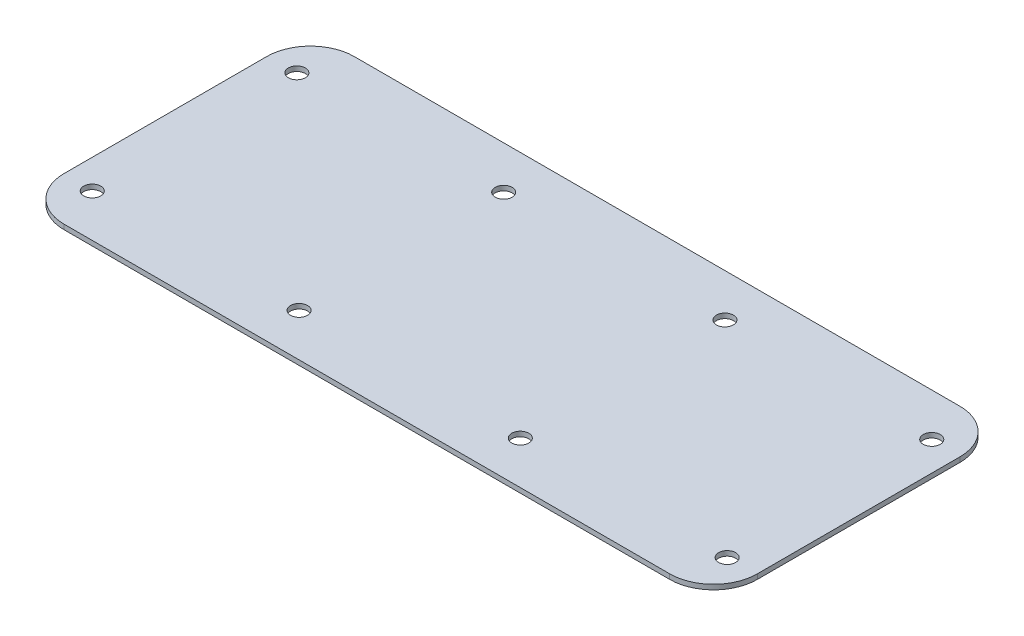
ISO-10303-21;
HEADER;
FILE_DESCRIPTION(('STEP AP214'),'2;1');
FILE_NAME('part.step','',(''),(''),'','','');
FILE_SCHEMA(('AUTOMOTIVE_DESIGN { 1 0 10303 214 1 1 1 1 }'));
ENDSEC;
DATA;
#1=APPLICATION_CONTEXT('core data for automotive mechanical design processes');
#2=APPLICATION_PROTOCOL_DEFINITION('international standard','automotive_design',2000,#1);
#3=PRODUCT_CONTEXT('',#1,'mechanical');
#4=PRODUCT('Part','Part','',(#3));
#5=PRODUCT_RELATED_PRODUCT_CATEGORY('part','',(#4));
#6=PRODUCT_DEFINITION_FORMATION('','',#4);
#7=PRODUCT_DEFINITION_CONTEXT('part definition',#1,'design');
#8=PRODUCT_DEFINITION('design','',#6,#7);
#9=PRODUCT_DEFINITION_SHAPE('','',#8);
#10=(LENGTH_UNIT() NAMED_UNIT(*) SI_UNIT(.MILLI.,.METRE.));
#11=(NAMED_UNIT(*) PLANE_ANGLE_UNIT() SI_UNIT($,.RADIAN.));
#12=(NAMED_UNIT(*) SI_UNIT($,.STERADIAN.) SOLID_ANGLE_UNIT());
#13=UNCERTAINTY_MEASURE_WITH_UNIT(LENGTH_MEASURE(1.E-05),#10,'distance_accuracy_value','');
#14=(GEOMETRIC_REPRESENTATION_CONTEXT(3) GLOBAL_UNCERTAINTY_ASSIGNED_CONTEXT((#13)) GLOBAL_UNIT_ASSIGNED_CONTEXT((#10,
#11,#12)) REPRESENTATION_CONTEXT('',''));
#15=CARTESIAN_POINT('',(0.,0.,0.));
#16=DIRECTION('',(0.,0.,1.));
#17=DIRECTION('',(1.,0.,0.));
#18=AXIS2_PLACEMENT_3D('',#15,#16,#17);
#19=CARTESIAN_POINT('',(0.,0.,0.));
#20=DIRECTION('',(0.,1.,0.));
#21=DIRECTION('',(0.,0.,1.));
#22=AXIS2_PLACEMENT_3D('',#19,#20,#21);
#23=PLANE('',#22);
#24=DIRECTION('',(-1.,0.,0.));
#25=VECTOR('',#24,1.);
#26=CARTESIAN_POINT('',(-231.822207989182,0.,-378.761207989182));
#27=LINE('',#26,#25);
#28=CARTESIAN_POINT('',(1348.99887465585,0.,-378.761207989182));
#29=VERTEX_POINT('',#28);
#30=CARTESIAN_POINT('',(-231.822207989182,0.,-378.761207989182));
#31=VERTEX_POINT('',#30);
#32=EDGE_CURVE('E140',#29,#31,#27,.T.);
#33=ORIENTED_EDGE('',*,*,#32,.F.);
#34=CARTESIAN_POINT('',(1348.99887465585,0.,-264.461207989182));
#35=DIRECTION('',(0.,1.,0.));
#36=DIRECTION('',(0.,0.,-1.));
#37=AXIS2_PLACEMENT_3D('',#34,#35,#36);
#38=CIRCLE('',#37,114.3);
#39=CARTESIAN_POINT('',(1463.29887465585,0.,-264.461207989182));
#40=VERTEX_POINT('',#39);
#41=EDGE_CURVE('E99',#40,#29,#38,.T.);
#42=ORIENTED_EDGE('',*,*,#41,.F.);
#43=DIRECTION('',(0.,0.,-1.));
#44=VECTOR('',#43,1.);
#45=CARTESIAN_POINT('',(1463.29887465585,0.,-264.461207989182));
#46=LINE('',#45,#44);
#47=CARTESIAN_POINT('',(1463.29887465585,0.,264.461207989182));
#48=VERTEX_POINT('',#47);
#49=EDGE_CURVE('E117',#48,#40,#46,.T.);
#50=ORIENTED_EDGE('',*,*,#49,.F.);
#51=CARTESIAN_POINT('',(1348.99887465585,0.,264.461207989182));
#52=DIRECTION('',(0.,1.,0.));
#53=DIRECTION('',(0.,0.,1.));
#54=AXIS2_PLACEMENT_3D('',#51,#52,#53);
#55=CIRCLE('',#54,114.3);
#56=CARTESIAN_POINT('',(1348.99887465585,0.,378.761207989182));
#57=VERTEX_POINT('',#56);
#58=EDGE_CURVE('E49',#57,#48,#55,.T.);
#59=ORIENTED_EDGE('',*,*,#58,.F.);
#60=DIRECTION('',(1.,0.,0.));
#61=VECTOR('',#60,1.);
#62=CARTESIAN_POINT('',(-231.822207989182,0.,378.761207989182));
#63=LINE('',#62,#61);
#64=CARTESIAN_POINT('',(-231.822207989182,0.,378.761207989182));
#65=VERTEX_POINT('',#64);
#66=EDGE_CURVE('E152',#65,#57,#63,.T.);
#67=ORIENTED_EDGE('',*,*,#66,.F.);
#68=CARTESIAN_POINT('',(-231.822207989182,0.,264.461207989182));
#69=DIRECTION('',(0.,1.,0.));
#70=DIRECTION('',(0.,0.,-1.));
#71=AXIS2_PLACEMENT_3D('',#68,#69,#70);
#72=CIRCLE('',#71,114.3);
#73=CARTESIAN_POINT('',(-346.122207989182,0.,264.461207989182));
#74=VERTEX_POINT('',#73);
#75=EDGE_CURVE('E149',#74,#65,#72,.T.);
#76=ORIENTED_EDGE('',*,*,#75,.F.);
#77=DIRECTION('',(0.,0.,1.));
#78=VECTOR('',#77,1.);
#79=CARTESIAN_POINT('',(-346.122207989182,0.,-264.461207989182));
#80=LINE('',#79,#78);
#81=CARTESIAN_POINT('',(-346.122207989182,0.,-264.461207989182));
#82=VERTEX_POINT('',#81);
#83=EDGE_CURVE('E146',#82,#74,#80,.T.);
#84=ORIENTED_EDGE('',*,*,#83,.F.);
#85=CARTESIAN_POINT('',(-231.822207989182,0.,-264.461207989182));
#86=DIRECTION('',(0.,1.,0.));
#87=DIRECTION('',(0.,0.,1.));
#88=AXIS2_PLACEMENT_3D('',#85,#86,#87);
#89=CIRCLE('',#88,114.3);
#90=EDGE_CURVE('E143',#31,#82,#89,.T.);
#91=ORIENTED_EDGE('',*,*,#90,.F.);
#92=EDGE_LOOP('',(#33,#42,#50,#59,#67,#76,#84,#91));
#93=FACE_BOUND('',#92,.T.);
#94=CARTESIAN_POINT('',(-269.922207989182,0.,-267.001207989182));
#95=DIRECTION('',(0.,1.,0.));
#96=DIRECTION('',(0.,0.,1.));
#97=AXIS2_PLACEMENT_3D('',#94,#95,#96);
#98=CIRCLE('',#97,22.225);
#99=CARTESIAN_POINT('',(-269.922207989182,0.,-289.226207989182));
#100=VERTEX_POINT('',#99);
#101=EDGE_CURVE('E141',#100,#100,#98,.T.);
#102=ORIENTED_EDGE('',*,*,#101,.T.);
#103=EDGE_LOOP('',(#102));
#104=FACE_BOUND('',#103,.T.);
#105=CARTESIAN_POINT('',(269.922207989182,0.,-267.001207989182));
#106=DIRECTION('',(0.,1.,0.));
#107=DIRECTION('',(0.,0.,1.));
#108=AXIS2_PLACEMENT_3D('',#105,#106,#107);
#109=CIRCLE('',#108,22.225);
#110=CARTESIAN_POINT('',(269.922207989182,0.,-289.226207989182));
#111=VERTEX_POINT('',#110);
#112=EDGE_CURVE('E362',#111,#111,#109,.T.);
#113=ORIENTED_EDGE('',*,*,#112,.T.);
#114=EDGE_LOOP('',(#113));
#115=FACE_BOUND('',#114,.T.);
#116=CARTESIAN_POINT('',(847.254458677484,0.,-267.001207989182));
#117=DIRECTION('',(0.,1.,0.));
#118=DIRECTION('',(0.,0.,1.));
#119=AXIS2_PLACEMENT_3D('',#116,#117,#118);
#120=CIRCLE('',#119,22.225);
#121=CARTESIAN_POINT('',(847.254458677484,0.,-289.226207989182));
#122=VERTEX_POINT('',#121);
#123=EDGE_CURVE('E356',#122,#122,#120,.T.);
#124=ORIENTED_EDGE('',*,*,#123,.T.);
#125=EDGE_LOOP('',(#124));
#126=FACE_BOUND('',#125,.T.);
#127=CARTESIAN_POINT('',(1387.09887465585,0.,-267.001207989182));
#128=DIRECTION('',(0.,1.,0.));
#129=DIRECTION('',(0.,0.,1.));
#130=AXIS2_PLACEMENT_3D('',#127,#128,#129);
#131=CIRCLE('',#130,22.225);
#132=CARTESIAN_POINT('',(1387.09887465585,0.,-289.226207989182));
#133=VERTEX_POINT('',#132);
#134=EDGE_CURVE('E350',#133,#133,#131,.T.);
#135=ORIENTED_EDGE('',*,*,#134,.T.);
#136=EDGE_LOOP('',(#135));
#137=FACE_BOUND('',#136,.T.);
#138=CARTESIAN_POINT('',(-269.922207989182,0.,267.001207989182));
#139=DIRECTION('',(0.,1.,0.));
#140=DIRECTION('',(0.,0.,1.));
#141=AXIS2_PLACEMENT_3D('',#138,#139,#140);
#142=CIRCLE('',#141,22.225);
#143=CARTESIAN_POINT('',(-269.922207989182,0.,244.776207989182));
#144=VERTEX_POINT('',#143);
#145=EDGE_CURVE('E344',#144,#144,#142,.T.);
#146=ORIENTED_EDGE('',*,*,#145,.T.);
#147=EDGE_LOOP('',(#146));
#148=FACE_BOUND('',#147,.T.);
#149=CARTESIAN_POINT('',(269.922207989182,0.,267.001207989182));
#150=DIRECTION('',(0.,1.,0.));
#151=DIRECTION('',(0.,0.,1.));
#152=AXIS2_PLACEMENT_3D('',#149,#150,#151);
#153=CIRCLE('',#152,22.225);
#154=CARTESIAN_POINT('',(269.922207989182,0.,244.776207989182));
#155=VERTEX_POINT('',#154);
#156=EDGE_CURVE('E338',#155,#155,#153,.T.);
#157=ORIENTED_EDGE('',*,*,#156,.T.);
#158=EDGE_LOOP('',(#157));
#159=FACE_BOUND('',#158,.T.);
#160=CARTESIAN_POINT('',(847.254458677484,0.,267.001207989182));
#161=DIRECTION('',(0.,1.,0.));
#162=DIRECTION('',(0.,0.,1.));
#163=AXIS2_PLACEMENT_3D('',#160,#161,#162);
#164=CIRCLE('',#163,22.225);
#165=CARTESIAN_POINT('',(847.254458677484,0.,244.776207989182));
#166=VERTEX_POINT('',#165);
#167=EDGE_CURVE('E332',#166,#166,#164,.T.);
#168=ORIENTED_EDGE('',*,*,#167,.T.);
#169=EDGE_LOOP('',(#168));
#170=FACE_BOUND('',#169,.T.);
#171=CARTESIAN_POINT('',(1387.09887465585,0.,267.001207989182));
#172=DIRECTION('',(0.,1.,0.));
#173=DIRECTION('',(0.,0.,1.));
#174=AXIS2_PLACEMENT_3D('',#171,#172,#173);
#175=CIRCLE('',#174,22.2250000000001);
#176=CARTESIAN_POINT('',(1387.09887465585,0.,244.776207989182));
#177=VERTEX_POINT('',#176);
#178=EDGE_CURVE('E323',#177,#177,#175,.T.);
#179=ORIENTED_EDGE('',*,*,#178,.T.);
#180=EDGE_LOOP('',(#179));
#181=FACE_BOUND('',#180,.T.);
#182=ADVANCED_FACE('F35',(#93,#104,#115,#126,#137,#148,#159,#170,#181),#23,.F.);
#183=CARTESIAN_POINT('',(0.,12.7,0.));
#184=DIRECTION('',(0.,1.,0.));
#185=DIRECTION('',(0.,0.,1.));
#186=AXIS2_PLACEMENT_3D('',#183,#184,#185);
#187=PLANE('',#186);
#188=CARTESIAN_POINT('',(1348.99887465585,12.7,-264.461207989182));
#189=DIRECTION('',(0.,1.,0.));
#190=DIRECTION('',(0.,0.,-1.));
#191=AXIS2_PLACEMENT_3D('',#188,#189,#190);
#192=CIRCLE('',#191,114.3);
#193=CARTESIAN_POINT('',(1463.29887465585,12.7,-264.461207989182));
#194=VERTEX_POINT('',#193);
#195=CARTESIAN_POINT('',(1348.99887465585,12.7,-378.761207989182));
#196=VERTEX_POINT('',#195);
#197=EDGE_CURVE('E57',#194,#196,#192,.T.);
#198=ORIENTED_EDGE('',*,*,#197,.T.);
#199=DIRECTION('',(-1.,0.,0.));
#200=VECTOR('',#199,1.);
#201=CARTESIAN_POINT('',(-231.822207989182,12.7,-378.761207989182));
#202=LINE('',#201,#200);
#203=CARTESIAN_POINT('',(-231.822207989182,12.7,-378.761207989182));
#204=VERTEX_POINT('',#203);
#205=EDGE_CURVE('E104',#196,#204,#202,.T.);
#206=ORIENTED_EDGE('',*,*,#205,.T.);
#207=CARTESIAN_POINT('',(-231.822207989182,12.7,-264.461207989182));
#208=DIRECTION('',(0.,1.,0.));
#209=DIRECTION('',(0.,0.,1.));
#210=AXIS2_PLACEMENT_3D('',#207,#208,#209);
#211=CIRCLE('',#210,114.3);
#212=CARTESIAN_POINT('',(-346.122207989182,12.7,-264.461207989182));
#213=VERTEX_POINT('',#212);
#214=EDGE_CURVE('E109',#204,#213,#211,.T.);
#215=ORIENTED_EDGE('',*,*,#214,.T.);
#216=DIRECTION('',(0.,0.,1.));
#217=VECTOR('',#216,1.);
#218=CARTESIAN_POINT('',(-346.122207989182,12.7,-264.461207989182));
#219=LINE('',#218,#217);
#220=CARTESIAN_POINT('',(-346.122207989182,12.7,264.461207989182));
#221=VERTEX_POINT('',#220);
#222=EDGE_CURVE('E126',#213,#221,#219,.T.);
#223=ORIENTED_EDGE('',*,*,#222,.T.);
#224=CARTESIAN_POINT('',(-231.822207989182,12.7,264.461207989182));
#225=DIRECTION('',(0.,1.,0.));
#226=DIRECTION('',(0.,0.,-1.));
#227=AXIS2_PLACEMENT_3D('',#224,#225,#226);
#228=CIRCLE('',#227,114.3);
#229=CARTESIAN_POINT('',(-231.822207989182,12.7,378.761207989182));
#230=VERTEX_POINT('',#229);
#231=EDGE_CURVE('E129',#221,#230,#228,.T.);
#232=ORIENTED_EDGE('',*,*,#231,.T.);
#233=DIRECTION('',(1.,0.,0.));
#234=VECTOR('',#233,1.);
#235=CARTESIAN_POINT('',(-231.822207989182,12.7,378.761207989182));
#236=LINE('',#235,#234);
#237=CARTESIAN_POINT('',(1348.99887465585,12.7,378.761207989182));
#238=VERTEX_POINT('',#237);
#239=EDGE_CURVE('E132',#230,#238,#236,.T.);
#240=ORIENTED_EDGE('',*,*,#239,.T.);
#241=CARTESIAN_POINT('',(1348.99887465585,12.7,264.461207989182));
#242=DIRECTION('',(0.,1.,0.));
#243=DIRECTION('',(0.,0.,1.));
#244=AXIS2_PLACEMENT_3D('',#241,#242,#243);
#245=CIRCLE('',#244,114.3);
#246=CARTESIAN_POINT('',(1463.29887465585,12.7,264.461207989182));
#247=VERTEX_POINT('',#246);
#248=EDGE_CURVE('E135',#238,#247,#245,.T.);
#249=ORIENTED_EDGE('',*,*,#248,.T.);
#250=DIRECTION('',(0.,0.,-1.));
#251=VECTOR('',#250,1.);
#252=CARTESIAN_POINT('',(1463.29887465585,12.7,-264.461207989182));
#253=LINE('',#252,#251);
#254=EDGE_CURVE('E116',#247,#194,#253,.T.);
#255=ORIENTED_EDGE('',*,*,#254,.T.);
#256=EDGE_LOOP('',(#198,#206,#215,#223,#232,#240,#249,#255));
#257=FACE_BOUND('',#256,.T.);
#258=CARTESIAN_POINT('',(-269.922207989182,12.7,-267.001207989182));
#259=DIRECTION('',(0.,1.,0.));
#260=DIRECTION('',(0.,0.,1.));
#261=AXIS2_PLACEMENT_3D('',#258,#259,#260);
#262=CIRCLE('',#261,22.225);
#263=CARTESIAN_POINT('',(-269.922207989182,12.7,-289.226207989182));
#264=VERTEX_POINT('',#263);
#265=EDGE_CURVE('E122',#264,#264,#262,.T.);
#266=ORIENTED_EDGE('',*,*,#265,.F.);
#267=EDGE_LOOP('',(#266));
#268=FACE_BOUND('',#267,.T.);
#269=CARTESIAN_POINT('',(269.922207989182,12.7,-267.001207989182));
#270=DIRECTION('',(0.,1.,0.));
#271=DIRECTION('',(0.,0.,1.));
#272=AXIS2_PLACEMENT_3D('',#269,#270,#271);
#273=CIRCLE('',#272,22.225);
#274=CARTESIAN_POINT('',(269.922207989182,12.7,-289.226207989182));
#275=VERTEX_POINT('',#274);
#276=EDGE_CURVE('E359',#275,#275,#273,.T.);
#277=ORIENTED_EDGE('',*,*,#276,.F.);
#278=EDGE_LOOP('',(#277));
#279=FACE_BOUND('',#278,.T.);
#280=CARTESIAN_POINT('',(847.254458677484,12.7,-267.001207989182));
#281=DIRECTION('',(0.,1.,0.));
#282=DIRECTION('',(0.,0.,1.));
#283=AXIS2_PLACEMENT_3D('',#280,#281,#282);
#284=CIRCLE('',#283,22.225);
#285=CARTESIAN_POINT('',(847.254458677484,12.7,-289.226207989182));
#286=VERTEX_POINT('',#285);
#287=EDGE_CURVE('E353',#286,#286,#284,.T.);
#288=ORIENTED_EDGE('',*,*,#287,.F.);
#289=EDGE_LOOP('',(#288));
#290=FACE_BOUND('',#289,.T.);
#291=CARTESIAN_POINT('',(1387.09887465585,12.7,-267.001207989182));
#292=DIRECTION('',(0.,1.,0.));
#293=DIRECTION('',(0.,0.,1.));
#294=AXIS2_PLACEMENT_3D('',#291,#292,#293);
#295=CIRCLE('',#294,22.225);
#296=CARTESIAN_POINT('',(1387.09887465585,12.7,-289.226207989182));
#297=VERTEX_POINT('',#296);
#298=EDGE_CURVE('E347',#297,#297,#295,.T.);
#299=ORIENTED_EDGE('',*,*,#298,.F.);
#300=EDGE_LOOP('',(#299));
#301=FACE_BOUND('',#300,.T.);
#302=CARTESIAN_POINT('',(-269.922207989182,12.7,267.001207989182));
#303=DIRECTION('',(0.,1.,0.));
#304=DIRECTION('',(0.,0.,1.));
#305=AXIS2_PLACEMENT_3D('',#302,#303,#304);
#306=CIRCLE('',#305,22.225);
#307=CARTESIAN_POINT('',(-269.922207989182,12.7,244.776207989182));
#308=VERTEX_POINT('',#307);
#309=EDGE_CURVE('E341',#308,#308,#306,.T.);
#310=ORIENTED_EDGE('',*,*,#309,.F.);
#311=EDGE_LOOP('',(#310));
#312=FACE_BOUND('',#311,.T.);
#313=CARTESIAN_POINT('',(269.922207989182,12.7,267.001207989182));
#314=DIRECTION('',(0.,1.,0.));
#315=DIRECTION('',(0.,0.,1.));
#316=AXIS2_PLACEMENT_3D('',#313,#314,#315);
#317=CIRCLE('',#316,22.225);
#318=CARTESIAN_POINT('',(269.922207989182,12.7,244.776207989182));
#319=VERTEX_POINT('',#318);
#320=EDGE_CURVE('E335',#319,#319,#317,.T.);
#321=ORIENTED_EDGE('',*,*,#320,.F.);
#322=EDGE_LOOP('',(#321));
#323=FACE_BOUND('',#322,.T.);
#324=CARTESIAN_POINT('',(847.254458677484,12.7,267.001207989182));
#325=DIRECTION('',(0.,1.,0.));
#326=DIRECTION('',(0.,0.,1.));
#327=AXIS2_PLACEMENT_3D('',#324,#325,#326);
#328=CIRCLE('',#327,22.225);
#329=CARTESIAN_POINT('',(847.254458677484,12.7,244.776207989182));
#330=VERTEX_POINT('',#329);
#331=EDGE_CURVE('E329',#330,#330,#328,.T.);
#332=ORIENTED_EDGE('',*,*,#331,.F.);
#333=EDGE_LOOP('',(#332));
#334=FACE_BOUND('',#333,.T.);
#335=CARTESIAN_POINT('',(1387.09887465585,12.7,267.001207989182));
#336=DIRECTION('',(0.,1.,0.));
#337=DIRECTION('',(0.,0.,1.));
#338=AXIS2_PLACEMENT_3D('',#335,#336,#337);
#339=CIRCLE('',#338,22.2250000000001);
#340=CARTESIAN_POINT('',(1387.09887465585,12.7,244.776207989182));
#341=VERTEX_POINT('',#340);
#342=EDGE_CURVE('E326',#341,#341,#339,.T.);
#343=ORIENTED_EDGE('',*,*,#342,.F.);
#344=EDGE_LOOP('',(#343));
#345=FACE_BOUND('',#344,.T.);
#346=ADVANCED_FACE('F112',(#257,#268,#279,#290,#301,#312,#323,#334,#345),#187,.T.);
#347=CARTESIAN_POINT('',(1348.99887465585,12.7,-264.461207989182));
#348=DIRECTION('',(0.,-1.,0.));
#349=DIRECTION('',(0.,0.,-1.));
#350=AXIS2_PLACEMENT_3D('',#347,#348,#349);
#351=CYLINDRICAL_SURFACE('',#350,114.3);
#352=ORIENTED_EDGE('',*,*,#41,.T.);
#353=DIRECTION('',(0.,-1.,0.));
#354=VECTOR('',#353,1.);
#355=CARTESIAN_POINT('',(1348.99887465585,12.7,-378.761207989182));
#356=LINE('',#355,#354);
#357=EDGE_CURVE('E11',#196,#29,#356,.T.);
#358=ORIENTED_EDGE('',*,*,#357,.F.);
#359=ORIENTED_EDGE('',*,*,#197,.F.);
#360=DIRECTION('',(0.,-1.,0.));
#361=VECTOR('',#360,1.);
#362=CARTESIAN_POINT('',(1463.29887465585,12.7,-264.461207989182));
#363=LINE('',#362,#361);
#364=EDGE_CURVE('E138',#194,#40,#363,.T.);
#365=ORIENTED_EDGE('',*,*,#364,.T.);
#366=EDGE_LOOP('',(#352,#358,#359,#365));
#367=FACE_BOUND('',#366,.T.);
#368=ADVANCED_FACE('F97',(#367),#351,.T.);
#369=CARTESIAN_POINT('',(-231.822207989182,12.7,-378.761207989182));
#370=DIRECTION('',(0.,0.,1.));
#371=DIRECTION('',(1.,0.,0.));
#372=AXIS2_PLACEMENT_3D('',#369,#370,#371);
#373=PLANE('',#372);
#374=ORIENTED_EDGE('',*,*,#32,.T.);
#375=DIRECTION('',(0.,-1.,0.));
#376=VECTOR('',#375,1.);
#377=CARTESIAN_POINT('',(-231.822207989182,12.7,-378.761207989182));
#378=LINE('',#377,#376);
#379=EDGE_CURVE('E42',#204,#31,#378,.T.);
#380=ORIENTED_EDGE('',*,*,#379,.F.);
#381=ORIENTED_EDGE('',*,*,#205,.F.);
#382=ORIENTED_EDGE('',*,*,#357,.T.);
#383=EDGE_LOOP('',(#374,#380,#381,#382));
#384=FACE_BOUND('',#383,.T.);
#385=ADVANCED_FACE('F105',(#384),#373,.F.);
#386=CARTESIAN_POINT('',(-231.822207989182,12.7,-264.461207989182));
#387=DIRECTION('',(0.,-1.,0.));
#388=DIRECTION('',(0.,0.,-1.));
#389=AXIS2_PLACEMENT_3D('',#386,#387,#388);
#390=CYLINDRICAL_SURFACE('',#389,114.3);
#391=ORIENTED_EDGE('',*,*,#90,.T.);
#392=DIRECTION('',(0.,-1.,0.));
#393=VECTOR('',#392,1.);
#394=CARTESIAN_POINT('',(-346.122207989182,12.7,-264.461207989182));
#395=LINE('',#394,#393);
#396=EDGE_CURVE('E165',#213,#82,#395,.T.);
#397=ORIENTED_EDGE('',*,*,#396,.F.);
#398=ORIENTED_EDGE('',*,*,#214,.F.);
#399=ORIENTED_EDGE('',*,*,#379,.T.);
#400=EDGE_LOOP('',(#391,#397,#398,#399));
#401=FACE_BOUND('',#400,.T.);
#402=ADVANCED_FACE('F167',(#401),#390,.T.);
#403=CARTESIAN_POINT('',(-346.122207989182,12.7,-264.461207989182));
#404=DIRECTION('',(1.,0.,0.));
#405=DIRECTION('',(0.,0.,-1.));
#406=AXIS2_PLACEMENT_3D('',#403,#404,#405);
#407=PLANE('',#406);
#408=ORIENTED_EDGE('',*,*,#83,.T.);
#409=DIRECTION('',(0.,-1.,0.));
#410=VECTOR('',#409,1.);
#411=CARTESIAN_POINT('',(-346.122207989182,12.7,264.461207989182));
#412=LINE('',#411,#410);
#413=EDGE_CURVE('E163',#221,#74,#412,.T.);
#414=ORIENTED_EDGE('',*,*,#413,.F.);
#415=ORIENTED_EDGE('',*,*,#222,.F.);
#416=ORIENTED_EDGE('',*,*,#396,.T.);
#417=EDGE_LOOP('',(#408,#414,#415,#416));
#418=FACE_BOUND('',#417,.T.);
#419=ADVANCED_FACE('F175',(#418),#407,.F.);
#420=CARTESIAN_POINT('',(-231.822207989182,12.7,264.461207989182));
#421=DIRECTION('',(0.,-1.,0.));
#422=DIRECTION('',(0.,0.,-1.));
#423=AXIS2_PLACEMENT_3D('',#420,#421,#422);
#424=CYLINDRICAL_SURFACE('',#423,114.3);
#425=ORIENTED_EDGE('',*,*,#75,.T.);
#426=DIRECTION('',(0.,-1.,0.));
#427=VECTOR('',#426,1.);
#428=CARTESIAN_POINT('',(-231.822207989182,12.7,378.761207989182));
#429=LINE('',#428,#427);
#430=EDGE_CURVE('E161',#230,#65,#429,.T.);
#431=ORIENTED_EDGE('',*,*,#430,.F.);
#432=ORIENTED_EDGE('',*,*,#231,.F.);
#433=ORIENTED_EDGE('',*,*,#413,.T.);
#434=EDGE_LOOP('',(#425,#431,#432,#433));
#435=FACE_BOUND('',#434,.T.);
#436=ADVANCED_FACE('F180',(#435),#424,.T.);
#437=CARTESIAN_POINT('',(-231.822207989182,12.7,378.761207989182));
#438=DIRECTION('',(0.,0.,-1.));
#439=DIRECTION('',(-1.,0.,0.));
#440=AXIS2_PLACEMENT_3D('',#437,#438,#439);
#441=PLANE('',#440);
#442=ORIENTED_EDGE('',*,*,#66,.T.);
#443=DIRECTION('',(0.,-1.,0.));
#444=VECTOR('',#443,1.);
#445=CARTESIAN_POINT('',(1348.99887465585,12.7,378.761207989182));
#446=LINE('',#445,#444);
#447=EDGE_CURVE('E159',#238,#57,#446,.T.);
#448=ORIENTED_EDGE('',*,*,#447,.F.);
#449=ORIENTED_EDGE('',*,*,#239,.F.);
#450=ORIENTED_EDGE('',*,*,#430,.T.);
#451=EDGE_LOOP('',(#442,#448,#449,#450));
#452=FACE_BOUND('',#451,.T.);
#453=ADVANCED_FACE('F182',(#452),#441,.F.);
#454=CARTESIAN_POINT('',(1348.99887465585,12.7,264.461207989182));
#455=DIRECTION('',(0.,-1.,0.));
#456=DIRECTION('',(0.,0.,-1.));
#457=AXIS2_PLACEMENT_3D('',#454,#455,#456);
#458=CYLINDRICAL_SURFACE('',#457,114.3);
#459=ORIENTED_EDGE('',*,*,#58,.T.);
#460=DIRECTION('',(0.,-1.,0.));
#461=VECTOR('',#460,1.);
#462=CARTESIAN_POINT('',(1463.29887465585,12.7,264.461207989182));
#463=LINE('',#462,#461);
#464=EDGE_CURVE('E157',#247,#48,#463,.T.);
#465=ORIENTED_EDGE('',*,*,#464,.F.);
#466=ORIENTED_EDGE('',*,*,#248,.F.);
#467=ORIENTED_EDGE('',*,*,#447,.T.);
#468=EDGE_LOOP('',(#459,#465,#466,#467));
#469=FACE_BOUND('',#468,.T.);
#470=ADVANCED_FACE('F184',(#469),#458,.T.);
#471=CARTESIAN_POINT('',(1463.29887465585,12.7,-264.461207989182));
#472=DIRECTION('',(-1.,0.,0.));
#473=DIRECTION('',(0.,0.,1.));
#474=AXIS2_PLACEMENT_3D('',#471,#472,#473);
#475=PLANE('',#474);
#476=ORIENTED_EDGE('',*,*,#49,.T.);
#477=ORIENTED_EDGE('',*,*,#364,.F.);
#478=ORIENTED_EDGE('',*,*,#254,.F.);
#479=ORIENTED_EDGE('',*,*,#464,.T.);
#480=EDGE_LOOP('',(#476,#477,#478,#479));
#481=FACE_BOUND('',#480,.T.);
#482=ADVANCED_FACE('F187',(#481),#475,.F.);
#483=CARTESIAN_POINT('',(-269.922207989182,102.502561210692,-267.001207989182));
#484=DIRECTION('',(0.,-1.,0.));
#485=DIRECTION('',(0.,0.,-1.));
#486=AXIS2_PLACEMENT_3D('',#483,#484,#485);
#487=CYLINDRICAL_SURFACE('',#486,22.225);
#488=CARTESIAN_POINT('',(-269.922207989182,0.,-289.226207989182));
#489=CARTESIAN_POINT('',(-269.922207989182,0.132291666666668,-289.226207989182));
#490=CARTESIAN_POINT('',(-269.922207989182,0.264583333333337,-289.226207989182));
#491=CARTESIAN_POINT('',(-269.922207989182,0.529166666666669,-289.226207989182));
#492=CARTESIAN_POINT('',(-269.922207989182,0.661458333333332,-289.226207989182));
#493=CARTESIAN_POINT('',(-269.922207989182,0.926041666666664,-289.226207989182));
#494=CARTESIAN_POINT('',(-269.922207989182,1.05833333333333,-289.226207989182));
#495=CARTESIAN_POINT('',(-269.922207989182,1.32291666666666,-289.226207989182));
#496=CARTESIAN_POINT('',(-269.922207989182,1.45520833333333,-289.226207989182));
#497=CARTESIAN_POINT('',(-269.922207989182,1.71979166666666,-289.226207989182));
#498=CARTESIAN_POINT('',(-269.922207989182,1.85208333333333,-289.226207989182));
#499=CARTESIAN_POINT('',(-269.922207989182,2.11666666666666,-289.226207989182));
#500=CARTESIAN_POINT('',(-269.922207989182,2.24895833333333,-289.226207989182));
#501=CARTESIAN_POINT('',(-269.922207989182,2.51354166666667,-289.226207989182));
#502=CARTESIAN_POINT('',(-269.922207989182,2.64583333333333,-289.226207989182));
#503=CARTESIAN_POINT('',(-269.922207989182,2.91041666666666,-289.226207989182));
#504=CARTESIAN_POINT('',(-269.922207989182,3.04270833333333,-289.226207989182));
#505=CARTESIAN_POINT('',(-269.922207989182,3.30729166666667,-289.226207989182));
#506=CARTESIAN_POINT('',(-269.922207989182,3.43958333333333,-289.226207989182));
#507=CARTESIAN_POINT('',(-269.922207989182,3.70416666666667,-289.226207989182));
#508=CARTESIAN_POINT('',(-269.922207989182,3.83645833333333,-289.226207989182));
#509=CARTESIAN_POINT('',(-269.922207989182,4.10104166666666,-289.226207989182));
#510=CARTESIAN_POINT('',(-269.922207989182,4.23333333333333,-289.226207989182));
#511=CARTESIAN_POINT('',(-269.922207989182,4.49791666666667,-289.226207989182));
#512=CARTESIAN_POINT('',(-269.922207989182,4.63020833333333,-289.226207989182));
#513=CARTESIAN_POINT('',(-269.922207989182,4.89479166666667,-289.226207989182));
#514=CARTESIAN_POINT('',(-269.922207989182,5.02708333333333,-289.226207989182));
#515=CARTESIAN_POINT('',(-269.922207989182,5.29166666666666,-289.226207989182));
#516=CARTESIAN_POINT('',(-269.922207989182,5.42395833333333,-289.226207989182));
#517=CARTESIAN_POINT('',(-269.922207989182,5.68854166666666,-289.226207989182));
#518=CARTESIAN_POINT('',(-269.922207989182,5.82083333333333,-289.226207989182));
#519=CARTESIAN_POINT('',(-269.922207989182,6.08541666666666,-289.226207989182));
#520=CARTESIAN_POINT('',(-269.922207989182,6.21770833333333,-289.226207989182));
#521=CARTESIAN_POINT('',(-269.922207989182,6.48229166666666,-289.226207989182));
#522=CARTESIAN_POINT('',(-269.922207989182,6.61458333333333,-289.226207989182));
#523=CARTESIAN_POINT('',(-269.922207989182,6.87916666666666,-289.226207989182));
#524=CARTESIAN_POINT('',(-269.922207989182,7.01145833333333,-289.226207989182));
#525=CARTESIAN_POINT('',(-269.922207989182,7.27604166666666,-289.226207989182));
#526=CARTESIAN_POINT('',(-269.922207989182,7.40833333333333,-289.226207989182));
#527=CARTESIAN_POINT('',(-269.922207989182,7.67291666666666,-289.226207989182));
#528=CARTESIAN_POINT('',(-269.922207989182,7.80520833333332,-289.226207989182));
#529=CARTESIAN_POINT('',(-269.922207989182,8.06979166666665,-289.226207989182));
#530=CARTESIAN_POINT('',(-269.922207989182,8.20208333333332,-289.226207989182));
#531=CARTESIAN_POINT('',(-269.922207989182,8.46666666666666,-289.226207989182));
#532=CARTESIAN_POINT('',(-269.922207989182,8.59895833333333,-289.226207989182));
#533=CARTESIAN_POINT('',(-269.922207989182,8.86354166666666,-289.226207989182));
#534=CARTESIAN_POINT('',(-269.922207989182,8.99583333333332,-289.226207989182));
#535=CARTESIAN_POINT('',(-269.922207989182,9.26041666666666,-289.226207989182));
#536=CARTESIAN_POINT('',(-269.922207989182,9.39270833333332,-289.226207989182));
#537=CARTESIAN_POINT('',(-269.922207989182,9.65729166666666,-289.226207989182));
#538=CARTESIAN_POINT('',(-269.922207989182,9.78958333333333,-289.226207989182));
#539=CARTESIAN_POINT('',(-269.922207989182,10.0541666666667,-289.226207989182));
#540=CARTESIAN_POINT('',(-269.922207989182,10.1864583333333,-289.226207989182));
#541=CARTESIAN_POINT('',(-269.922207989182,10.4510416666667,-289.226207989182));
#542=CARTESIAN_POINT('',(-269.922207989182,10.5833333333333,-289.226207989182));
#543=CARTESIAN_POINT('',(-269.922207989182,10.8479166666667,-289.226207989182));
#544=CARTESIAN_POINT('',(-269.922207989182,10.9802083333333,-289.226207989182));
#545=CARTESIAN_POINT('',(-269.922207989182,11.2447916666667,-289.226207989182));
#546=CARTESIAN_POINT('',(-269.922207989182,11.3770833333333,-289.226207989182));
#547=CARTESIAN_POINT('',(-269.922207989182,11.6416666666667,-289.226207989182));
#548=CARTESIAN_POINT('',(-269.922207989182,11.7739583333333,-289.226207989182));
#549=CARTESIAN_POINT('',(-269.922207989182,12.0385416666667,-289.226207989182));
#550=CARTESIAN_POINT('',(-269.922207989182,12.1708333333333,-289.226207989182));
#551=CARTESIAN_POINT('',(-269.922207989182,12.4354166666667,-289.226207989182));
#552=CARTESIAN_POINT('',(-269.922207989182,12.5677083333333,-289.226207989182));
#553=CARTESIAN_POINT('',(-269.922207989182,12.7,-289.226207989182));
#554=B_SPLINE_CURVE_WITH_KNOTS('',3,(#488,#489,#490,#491,#492,#493,#494,#495,#496,#497,#498,
#499,#500,#501,#502,#503,#504,#505,#506,#507,#508,#509,#510,#511,#512,#513,#514,#515,#516,#517,
#518,#519,#520,#521,#522,#523,#524,#525,#526,#527,#528,#529,#530,#531,#532,#533,#534,#535,#536,
#537,#538,#539,#540,#541,#542,#543,#544,#545,#546,#547,#548,#549,#550,#551,#552,#553),
.UNSPECIFIED.,.F.,.F.,(4,2,2,2,2,2,2,2,2,2,2,2,2,2,2,2,2,2,2,2,2,2,2,2,2,2,2,2,2,2,2,2,4),(0.,
0.396875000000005,0.793749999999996,1.190625,1.58749999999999,1.984375,2.38125,2.77812499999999,
3.175,3.571875,3.96874999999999,4.365625,4.7625,5.15937499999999,5.55625,5.95312499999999,
6.34999999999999,6.746875,7.14374999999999,7.540625,7.93749999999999,8.33437499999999,8.73125,
9.12812499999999,9.52499999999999,9.921875,10.31875,10.715625,11.1125,11.509375,11.90625,
12.303125,12.7),.UNSPECIFIED.);
#555=EDGE_CURVE('BSEAM189',#100,#264,#554,.T.);
#556=ORIENTED_EDGE('',*,*,#101,.F.);
#557=ORIENTED_EDGE('',*,*,#265,.T.);
#558=ORIENTED_EDGE('',*,*,#555,.T.);
#559=ORIENTED_EDGE('',*,*,#555,.F.);
#560=EDGE_LOOP('',(#556,#558,#557,#559));
#561=FACE_BOUND('',#560,.T.);
#562=ADVANCED_FACE('F189',(#561),#487,.F.);
#563=CARTESIAN_POINT('',(269.922207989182,102.502561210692,-267.001207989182));
#564=DIRECTION('',(0.,-1.,0.));
#565=DIRECTION('',(0.,0.,-1.));
#566=AXIS2_PLACEMENT_3D('',#563,#564,#565);
#567=CYLINDRICAL_SURFACE('',#566,22.225);
#568=CARTESIAN_POINT('',(269.922207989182,0.,-289.226207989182));
#569=CARTESIAN_POINT('',(269.922207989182,0.132291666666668,-289.226207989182));
#570=CARTESIAN_POINT('',(269.922207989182,0.264583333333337,-289.226207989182));
#571=CARTESIAN_POINT('',(269.922207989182,0.529166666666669,-289.226207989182));
#572=CARTESIAN_POINT('',(269.922207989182,0.661458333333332,-289.226207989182));
#573=CARTESIAN_POINT('',(269.922207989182,0.926041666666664,-289.226207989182));
#574=CARTESIAN_POINT('',(269.922207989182,1.05833333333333,-289.226207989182));
#575=CARTESIAN_POINT('',(269.922207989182,1.32291666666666,-289.226207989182));
#576=CARTESIAN_POINT('',(269.922207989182,1.45520833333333,-289.226207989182));
#577=CARTESIAN_POINT('',(269.922207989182,1.71979166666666,-289.226207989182));
#578=CARTESIAN_POINT('',(269.922207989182,1.85208333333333,-289.226207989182));
#579=CARTESIAN_POINT('',(269.922207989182,2.11666666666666,-289.226207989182));
#580=CARTESIAN_POINT('',(269.922207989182,2.24895833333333,-289.226207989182));
#581=CARTESIAN_POINT('',(269.922207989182,2.51354166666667,-289.226207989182));
#582=CARTESIAN_POINT('',(269.922207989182,2.64583333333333,-289.226207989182));
#583=CARTESIAN_POINT('',(269.922207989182,2.91041666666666,-289.226207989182));
#584=CARTESIAN_POINT('',(269.922207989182,3.04270833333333,-289.226207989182));
#585=CARTESIAN_POINT('',(269.922207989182,3.30729166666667,-289.226207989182));
#586=CARTESIAN_POINT('',(269.922207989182,3.43958333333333,-289.226207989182));
#587=CARTESIAN_POINT('',(269.922207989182,3.70416666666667,-289.226207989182));
#588=CARTESIAN_POINT('',(269.922207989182,3.83645833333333,-289.226207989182));
#589=CARTESIAN_POINT('',(269.922207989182,4.10104166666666,-289.226207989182));
#590=CARTESIAN_POINT('',(269.922207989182,4.23333333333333,-289.226207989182));
#591=CARTESIAN_POINT('',(269.922207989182,4.49791666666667,-289.226207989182));
#592=CARTESIAN_POINT('',(269.922207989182,4.63020833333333,-289.226207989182));
#593=CARTESIAN_POINT('',(269.922207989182,4.89479166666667,-289.226207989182));
#594=CARTESIAN_POINT('',(269.922207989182,5.02708333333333,-289.226207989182));
#595=CARTESIAN_POINT('',(269.922207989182,5.29166666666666,-289.226207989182));
#596=CARTESIAN_POINT('',(269.922207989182,5.42395833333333,-289.226207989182));
#597=CARTESIAN_POINT('',(269.922207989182,5.68854166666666,-289.226207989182));
#598=CARTESIAN_POINT('',(269.922207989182,5.82083333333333,-289.226207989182));
#599=CARTESIAN_POINT('',(269.922207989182,6.08541666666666,-289.226207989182));
#600=CARTESIAN_POINT('',(269.922207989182,6.21770833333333,-289.226207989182));
#601=CARTESIAN_POINT('',(269.922207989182,6.48229166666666,-289.226207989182));
#602=CARTESIAN_POINT('',(269.922207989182,6.61458333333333,-289.226207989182));
#603=CARTESIAN_POINT('',(269.922207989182,6.87916666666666,-289.226207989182));
#604=CARTESIAN_POINT('',(269.922207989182,7.01145833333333,-289.226207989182));
#605=CARTESIAN_POINT('',(269.922207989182,7.27604166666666,-289.226207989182));
#606=CARTESIAN_POINT('',(269.922207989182,7.40833333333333,-289.226207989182));
#607=CARTESIAN_POINT('',(269.922207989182,7.67291666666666,-289.226207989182));
#608=CARTESIAN_POINT('',(269.922207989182,7.80520833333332,-289.226207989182));
#609=CARTESIAN_POINT('',(269.922207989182,8.06979166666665,-289.226207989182));
#610=CARTESIAN_POINT('',(269.922207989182,8.20208333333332,-289.226207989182));
#611=CARTESIAN_POINT('',(269.922207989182,8.46666666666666,-289.226207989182));
#612=CARTESIAN_POINT('',(269.922207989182,8.59895833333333,-289.226207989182));
#613=CARTESIAN_POINT('',(269.922207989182,8.86354166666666,-289.226207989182));
#614=CARTESIAN_POINT('',(269.922207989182,8.99583333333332,-289.226207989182));
#615=CARTESIAN_POINT('',(269.922207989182,9.26041666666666,-289.226207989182));
#616=CARTESIAN_POINT('',(269.922207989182,9.39270833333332,-289.226207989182));
#617=CARTESIAN_POINT('',(269.922207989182,9.65729166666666,-289.226207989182));
#618=CARTESIAN_POINT('',(269.922207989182,9.78958333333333,-289.226207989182));
#619=CARTESIAN_POINT('',(269.922207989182,10.0541666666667,-289.226207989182));
#620=CARTESIAN_POINT('',(269.922207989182,10.1864583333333,-289.226207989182));
#621=CARTESIAN_POINT('',(269.922207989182,10.4510416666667,-289.226207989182));
#622=CARTESIAN_POINT('',(269.922207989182,10.5833333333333,-289.226207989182));
#623=CARTESIAN_POINT('',(269.922207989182,10.8479166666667,-289.226207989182));
#624=CARTESIAN_POINT('',(269.922207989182,10.9802083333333,-289.226207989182));
#625=CARTESIAN_POINT('',(269.922207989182,11.2447916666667,-289.226207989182));
#626=CARTESIAN_POINT('',(269.922207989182,11.3770833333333,-289.226207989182));
#627=CARTESIAN_POINT('',(269.922207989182,11.6416666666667,-289.226207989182));
#628=CARTESIAN_POINT('',(269.922207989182,11.7739583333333,-289.226207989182));
#629=CARTESIAN_POINT('',(269.922207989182,12.0385416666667,-289.226207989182));
#630=CARTESIAN_POINT('',(269.922207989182,12.1708333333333,-289.226207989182));
#631=CARTESIAN_POINT('',(269.922207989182,12.4354166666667,-289.226207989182));
#632=CARTESIAN_POINT('',(269.922207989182,12.5677083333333,-289.226207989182));
#633=CARTESIAN_POINT('',(269.922207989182,12.7,-289.226207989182));
#634=B_SPLINE_CURVE_WITH_KNOTS('',3,(#568,#569,#570,#571,#572,#573,#574,#575,#576,#577,#578,
#579,#580,#581,#582,#583,#584,#585,#586,#587,#588,#589,#590,#591,#592,#593,#594,#595,#596,#597,
#598,#599,#600,#601,#602,#603,#604,#605,#606,#607,#608,#609,#610,#611,#612,#613,#614,#615,#616,
#617,#618,#619,#620,#621,#622,#623,#624,#625,#626,#627,#628,#629,#630,#631,#632,#633),
.UNSPECIFIED.,.F.,.F.,(4,2,2,2,2,2,2,2,2,2,2,2,2,2,2,2,2,2,2,2,2,2,2,2,2,2,2,2,2,2,2,2,4),(0.,
0.396875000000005,0.793749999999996,1.190625,1.58749999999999,1.984375,2.38125,2.77812499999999,
3.175,3.571875,3.96874999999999,4.365625,4.7625,5.15937499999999,5.55625,5.95312499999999,
6.34999999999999,6.746875,7.14374999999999,7.540625,7.93749999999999,8.33437499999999,8.73125,
9.12812499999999,9.52499999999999,9.921875,10.31875,10.715625,11.1125,11.509375,11.90625,
12.303125,12.7),.UNSPECIFIED.);
#635=EDGE_CURVE('BSEAM195',#111,#275,#634,.T.);
#636=ORIENTED_EDGE('',*,*,#112,.F.);
#637=ORIENTED_EDGE('',*,*,#276,.T.);
#638=ORIENTED_EDGE('',*,*,#635,.T.);
#639=ORIENTED_EDGE('',*,*,#635,.F.);
#640=EDGE_LOOP('',(#636,#638,#637,#639));
#641=FACE_BOUND('',#640,.T.);
#642=ADVANCED_FACE('F195',(#641),#567,.F.);
#643=CARTESIAN_POINT('',(847.254458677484,102.502561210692,-267.001207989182));
#644=DIRECTION('',(0.,-1.,0.));
#645=DIRECTION('',(0.,0.,-1.));
#646=AXIS2_PLACEMENT_3D('',#643,#644,#645);
#647=CYLINDRICAL_SURFACE('',#646,22.225);
#648=CARTESIAN_POINT('',(847.254458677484,0.,-289.226207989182));
#649=CARTESIAN_POINT('',(847.254458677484,0.132291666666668,-289.226207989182));
#650=CARTESIAN_POINT('',(847.254458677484,0.264583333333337,-289.226207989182));
#651=CARTESIAN_POINT('',(847.254458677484,0.529166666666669,-289.226207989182));
#652=CARTESIAN_POINT('',(847.254458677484,0.661458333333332,-289.226207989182));
#653=CARTESIAN_POINT('',(847.254458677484,0.926041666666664,-289.226207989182));
#654=CARTESIAN_POINT('',(847.254458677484,1.05833333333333,-289.226207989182));
#655=CARTESIAN_POINT('',(847.254458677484,1.32291666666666,-289.226207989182));
#656=CARTESIAN_POINT('',(847.254458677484,1.45520833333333,-289.226207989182));
#657=CARTESIAN_POINT('',(847.254458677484,1.71979166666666,-289.226207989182));
#658=CARTESIAN_POINT('',(847.254458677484,1.85208333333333,-289.226207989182));
#659=CARTESIAN_POINT('',(847.254458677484,2.11666666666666,-289.226207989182));
#660=CARTESIAN_POINT('',(847.254458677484,2.24895833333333,-289.226207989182));
#661=CARTESIAN_POINT('',(847.254458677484,2.51354166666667,-289.226207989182));
#662=CARTESIAN_POINT('',(847.254458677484,2.64583333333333,-289.226207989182));
#663=CARTESIAN_POINT('',(847.254458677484,2.91041666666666,-289.226207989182));
#664=CARTESIAN_POINT('',(847.254458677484,3.04270833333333,-289.226207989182));
#665=CARTESIAN_POINT('',(847.254458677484,3.30729166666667,-289.226207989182));
#666=CARTESIAN_POINT('',(847.254458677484,3.43958333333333,-289.226207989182));
#667=CARTESIAN_POINT('',(847.254458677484,3.70416666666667,-289.226207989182));
#668=CARTESIAN_POINT('',(847.254458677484,3.83645833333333,-289.226207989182));
#669=CARTESIAN_POINT('',(847.254458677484,4.10104166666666,-289.226207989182));
#670=CARTESIAN_POINT('',(847.254458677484,4.23333333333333,-289.226207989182));
#671=CARTESIAN_POINT('',(847.254458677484,4.49791666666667,-289.226207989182));
#672=CARTESIAN_POINT('',(847.254458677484,4.63020833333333,-289.226207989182));
#673=CARTESIAN_POINT('',(847.254458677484,4.89479166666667,-289.226207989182));
#674=CARTESIAN_POINT('',(847.254458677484,5.02708333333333,-289.226207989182));
#675=CARTESIAN_POINT('',(847.254458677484,5.29166666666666,-289.226207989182));
#676=CARTESIAN_POINT('',(847.254458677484,5.42395833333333,-289.226207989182));
#677=CARTESIAN_POINT('',(847.254458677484,5.68854166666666,-289.226207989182));
#678=CARTESIAN_POINT('',(847.254458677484,5.82083333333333,-289.226207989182));
#679=CARTESIAN_POINT('',(847.254458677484,6.08541666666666,-289.226207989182));
#680=CARTESIAN_POINT('',(847.254458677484,6.21770833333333,-289.226207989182));
#681=CARTESIAN_POINT('',(847.254458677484,6.48229166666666,-289.226207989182));
#682=CARTESIAN_POINT('',(847.254458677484,6.61458333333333,-289.226207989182));
#683=CARTESIAN_POINT('',(847.254458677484,6.87916666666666,-289.226207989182));
#684=CARTESIAN_POINT('',(847.254458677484,7.01145833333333,-289.226207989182));
#685=CARTESIAN_POINT('',(847.254458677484,7.27604166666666,-289.226207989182));
#686=CARTESIAN_POINT('',(847.254458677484,7.40833333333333,-289.226207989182));
#687=CARTESIAN_POINT('',(847.254458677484,7.67291666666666,-289.226207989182));
#688=CARTESIAN_POINT('',(847.254458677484,7.80520833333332,-289.226207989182));
#689=CARTESIAN_POINT('',(847.254458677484,8.06979166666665,-289.226207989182));
#690=CARTESIAN_POINT('',(847.254458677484,8.20208333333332,-289.226207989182));
#691=CARTESIAN_POINT('',(847.254458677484,8.46666666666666,-289.226207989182));
#692=CARTESIAN_POINT('',(847.254458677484,8.59895833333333,-289.226207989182));
#693=CARTESIAN_POINT('',(847.254458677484,8.86354166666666,-289.226207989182));
#694=CARTESIAN_POINT('',(847.254458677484,8.99583333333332,-289.226207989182));
#695=CARTESIAN_POINT('',(847.254458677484,9.26041666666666,-289.226207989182));
#696=CARTESIAN_POINT('',(847.254458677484,9.39270833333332,-289.226207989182));
#697=CARTESIAN_POINT('',(847.254458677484,9.65729166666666,-289.226207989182));
#698=CARTESIAN_POINT('',(847.254458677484,9.78958333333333,-289.226207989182));
#699=CARTESIAN_POINT('',(847.254458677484,10.0541666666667,-289.226207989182));
#700=CARTESIAN_POINT('',(847.254458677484,10.1864583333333,-289.226207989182));
#701=CARTESIAN_POINT('',(847.254458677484,10.4510416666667,-289.226207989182));
#702=CARTESIAN_POINT('',(847.254458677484,10.5833333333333,-289.226207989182));
#703=CARTESIAN_POINT('',(847.254458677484,10.8479166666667,-289.226207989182));
#704=CARTESIAN_POINT('',(847.254458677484,10.9802083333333,-289.226207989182));
#705=CARTESIAN_POINT('',(847.254458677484,11.2447916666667,-289.226207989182));
#706=CARTESIAN_POINT('',(847.254458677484,11.3770833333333,-289.226207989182));
#707=CARTESIAN_POINT('',(847.254458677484,11.6416666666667,-289.226207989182));
#708=CARTESIAN_POINT('',(847.254458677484,11.7739583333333,-289.226207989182));
#709=CARTESIAN_POINT('',(847.254458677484,12.0385416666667,-289.226207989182));
#710=CARTESIAN_POINT('',(847.254458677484,12.1708333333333,-289.226207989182));
#711=CARTESIAN_POINT('',(847.254458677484,12.4354166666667,-289.226207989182));
#712=CARTESIAN_POINT('',(847.254458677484,12.5677083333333,-289.226207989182));
#713=CARTESIAN_POINT('',(847.254458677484,12.7,-289.226207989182));
#714=B_SPLINE_CURVE_WITH_KNOTS('',3,(#648,#649,#650,#651,#652,#653,#654,#655,#656,#657,#658,
#659,#660,#661,#662,#663,#664,#665,#666,#667,#668,#669,#670,#671,#672,#673,#674,#675,#676,#677,
#678,#679,#680,#681,#682,#683,#684,#685,#686,#687,#688,#689,#690,#691,#692,#693,#694,#695,#696,
#697,#698,#699,#700,#701,#702,#703,#704,#705,#706,#707,#708,#709,#710,#711,#712,#713),
.UNSPECIFIED.,.F.,.F.,(4,2,2,2,2,2,2,2,2,2,2,2,2,2,2,2,2,2,2,2,2,2,2,2,2,2,2,2,2,2,2,2,4),(0.,
0.396875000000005,0.793749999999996,1.190625,1.58749999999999,1.984375,2.38125,2.77812499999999,
3.175,3.571875,3.96874999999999,4.365625,4.7625,5.15937499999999,5.55625,5.95312499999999,
6.34999999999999,6.746875,7.14374999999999,7.540625,7.93749999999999,8.33437499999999,8.73125,
9.12812499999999,9.52499999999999,9.921875,10.31875,10.715625,11.1125,11.509375,11.90625,
12.303125,12.7),.UNSPECIFIED.);
#715=EDGE_CURVE('BSEAM256',#122,#286,#714,.T.);
#716=ORIENTED_EDGE('',*,*,#123,.F.);
#717=ORIENTED_EDGE('',*,*,#287,.T.);
#718=ORIENTED_EDGE('',*,*,#715,.T.);
#719=ORIENTED_EDGE('',*,*,#715,.F.);
#720=EDGE_LOOP('',(#716,#718,#717,#719));
#721=FACE_BOUND('',#720,.T.);
#722=ADVANCED_FACE('F256',(#721),#647,.F.);
#723=CARTESIAN_POINT('',(1387.09887465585,102.502561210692,-267.001207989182));
#724=DIRECTION('',(0.,-1.,0.));
#725=DIRECTION('',(0.,0.,-1.));
#726=AXIS2_PLACEMENT_3D('',#723,#724,#725);
#727=CYLINDRICAL_SURFACE('',#726,22.225);
#728=CARTESIAN_POINT('',(1387.09887465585,0.,-289.226207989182));
#729=CARTESIAN_POINT('',(1387.09887465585,0.132291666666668,-289.226207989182));
#730=CARTESIAN_POINT('',(1387.09887465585,0.264583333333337,-289.226207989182));
#731=CARTESIAN_POINT('',(1387.09887465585,0.529166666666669,-289.226207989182));
#732=CARTESIAN_POINT('',(1387.09887465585,0.661458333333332,-289.226207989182));
#733=CARTESIAN_POINT('',(1387.09887465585,0.926041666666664,-289.226207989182));
#734=CARTESIAN_POINT('',(1387.09887465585,1.05833333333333,-289.226207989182));
#735=CARTESIAN_POINT('',(1387.09887465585,1.32291666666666,-289.226207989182));
#736=CARTESIAN_POINT('',(1387.09887465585,1.45520833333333,-289.226207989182));
#737=CARTESIAN_POINT('',(1387.09887465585,1.71979166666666,-289.226207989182));
#738=CARTESIAN_POINT('',(1387.09887465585,1.85208333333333,-289.226207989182));
#739=CARTESIAN_POINT('',(1387.09887465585,2.11666666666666,-289.226207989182));
#740=CARTESIAN_POINT('',(1387.09887465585,2.24895833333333,-289.226207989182));
#741=CARTESIAN_POINT('',(1387.09887465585,2.51354166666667,-289.226207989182));
#742=CARTESIAN_POINT('',(1387.09887465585,2.64583333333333,-289.226207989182));
#743=CARTESIAN_POINT('',(1387.09887465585,2.91041666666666,-289.226207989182));
#744=CARTESIAN_POINT('',(1387.09887465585,3.04270833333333,-289.226207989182));
#745=CARTESIAN_POINT('',(1387.09887465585,3.30729166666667,-289.226207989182));
#746=CARTESIAN_POINT('',(1387.09887465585,3.43958333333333,-289.226207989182));
#747=CARTESIAN_POINT('',(1387.09887465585,3.70416666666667,-289.226207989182));
#748=CARTESIAN_POINT('',(1387.09887465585,3.83645833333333,-289.226207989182));
#749=CARTESIAN_POINT('',(1387.09887465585,4.10104166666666,-289.226207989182));
#750=CARTESIAN_POINT('',(1387.09887465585,4.23333333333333,-289.226207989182));
#751=CARTESIAN_POINT('',(1387.09887465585,4.49791666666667,-289.226207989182));
#752=CARTESIAN_POINT('',(1387.09887465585,4.63020833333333,-289.226207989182));
#753=CARTESIAN_POINT('',(1387.09887465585,4.89479166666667,-289.226207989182));
#754=CARTESIAN_POINT('',(1387.09887465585,5.02708333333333,-289.226207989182));
#755=CARTESIAN_POINT('',(1387.09887465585,5.29166666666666,-289.226207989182));
#756=CARTESIAN_POINT('',(1387.09887465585,5.42395833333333,-289.226207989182));
#757=CARTESIAN_POINT('',(1387.09887465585,5.68854166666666,-289.226207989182));
#758=CARTESIAN_POINT('',(1387.09887465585,5.82083333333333,-289.226207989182));
#759=CARTESIAN_POINT('',(1387.09887465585,6.08541666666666,-289.226207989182));
#760=CARTESIAN_POINT('',(1387.09887465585,6.21770833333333,-289.226207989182));
#761=CARTESIAN_POINT('',(1387.09887465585,6.48229166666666,-289.226207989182));
#762=CARTESIAN_POINT('',(1387.09887465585,6.61458333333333,-289.226207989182));
#763=CARTESIAN_POINT('',(1387.09887465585,6.87916666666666,-289.226207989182));
#764=CARTESIAN_POINT('',(1387.09887465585,7.01145833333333,-289.226207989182));
#765=CARTESIAN_POINT('',(1387.09887465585,7.27604166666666,-289.226207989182));
#766=CARTESIAN_POINT('',(1387.09887465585,7.40833333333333,-289.226207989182));
#767=CARTESIAN_POINT('',(1387.09887465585,7.67291666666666,-289.226207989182));
#768=CARTESIAN_POINT('',(1387.09887465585,7.80520833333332,-289.226207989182));
#769=CARTESIAN_POINT('',(1387.09887465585,8.06979166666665,-289.226207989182));
#770=CARTESIAN_POINT('',(1387.09887465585,8.20208333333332,-289.226207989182));
#771=CARTESIAN_POINT('',(1387.09887465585,8.46666666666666,-289.226207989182));
#772=CARTESIAN_POINT('',(1387.09887465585,8.59895833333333,-289.226207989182));
#773=CARTESIAN_POINT('',(1387.09887465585,8.86354166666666,-289.226207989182));
#774=CARTESIAN_POINT('',(1387.09887465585,8.99583333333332,-289.226207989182));
#775=CARTESIAN_POINT('',(1387.09887465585,9.26041666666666,-289.226207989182));
#776=CARTESIAN_POINT('',(1387.09887465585,9.39270833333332,-289.226207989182));
#777=CARTESIAN_POINT('',(1387.09887465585,9.65729166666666,-289.226207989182));
#778=CARTESIAN_POINT('',(1387.09887465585,9.78958333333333,-289.226207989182));
#779=CARTESIAN_POINT('',(1387.09887465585,10.0541666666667,-289.226207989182));
#780=CARTESIAN_POINT('',(1387.09887465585,10.1864583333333,-289.226207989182));
#781=CARTESIAN_POINT('',(1387.09887465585,10.4510416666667,-289.226207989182));
#782=CARTESIAN_POINT('',(1387.09887465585,10.5833333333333,-289.226207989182));
#783=CARTESIAN_POINT('',(1387.09887465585,10.8479166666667,-289.226207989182));
#784=CARTESIAN_POINT('',(1387.09887465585,10.9802083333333,-289.226207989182));
#785=CARTESIAN_POINT('',(1387.09887465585,11.2447916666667,-289.226207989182));
#786=CARTESIAN_POINT('',(1387.09887465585,11.3770833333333,-289.226207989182));
#787=CARTESIAN_POINT('',(1387.09887465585,11.6416666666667,-289.226207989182));
#788=CARTESIAN_POINT('',(1387.09887465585,11.7739583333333,-289.226207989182));
#789=CARTESIAN_POINT('',(1387.09887465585,12.0385416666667,-289.226207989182));
#790=CARTESIAN_POINT('',(1387.09887465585,12.1708333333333,-289.226207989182));
#791=CARTESIAN_POINT('',(1387.09887465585,12.4354166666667,-289.226207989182));
#792=CARTESIAN_POINT('',(1387.09887465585,12.5677083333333,-289.226207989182));
#793=CARTESIAN_POINT('',(1387.09887465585,12.7,-289.226207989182));
#794=B_SPLINE_CURVE_WITH_KNOTS('',3,(#728,#729,#730,#731,#732,#733,#734,#735,#736,#737,#738,
#739,#740,#741,#742,#743,#744,#745,#746,#747,#748,#749,#750,#751,#752,#753,#754,#755,#756,#757,
#758,#759,#760,#761,#762,#763,#764,#765,#766,#767,#768,#769,#770,#771,#772,#773,#774,#775,#776,
#777,#778,#779,#780,#781,#782,#783,#784,#785,#786,#787,#788,#789,#790,#791,#792,#793),
.UNSPECIFIED.,.F.,.F.,(4,2,2,2,2,2,2,2,2,2,2,2,2,2,2,2,2,2,2,2,2,2,2,2,2,2,2,2,2,2,2,2,4),(0.,
0.396875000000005,0.793749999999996,1.190625,1.58749999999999,1.984375,2.38125,2.77812499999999,
3.175,3.571875,3.96874999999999,4.365625,4.7625,5.15937499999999,5.55625,5.95312499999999,
6.34999999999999,6.746875,7.14374999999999,7.540625,7.93749999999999,8.33437499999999,8.73125,
9.12812499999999,9.52499999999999,9.921875,10.31875,10.715625,11.1125,11.509375,11.90625,
12.303125,12.7),.UNSPECIFIED.);
#795=EDGE_CURVE('BSEAM266',#133,#297,#794,.T.);
#796=ORIENTED_EDGE('',*,*,#134,.F.);
#797=ORIENTED_EDGE('',*,*,#298,.T.);
#798=ORIENTED_EDGE('',*,*,#795,.T.);
#799=ORIENTED_EDGE('',*,*,#795,.F.);
#800=EDGE_LOOP('',(#796,#798,#797,#799));
#801=FACE_BOUND('',#800,.T.);
#802=ADVANCED_FACE('F266',(#801),#727,.F.);
#803=CARTESIAN_POINT('',(-269.922207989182,102.502561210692,267.001207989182));
#804=DIRECTION('',(0.,-1.,0.));
#805=DIRECTION('',(0.,0.,-1.));
#806=AXIS2_PLACEMENT_3D('',#803,#804,#805);
#807=CYLINDRICAL_SURFACE('',#806,22.225);
#808=CARTESIAN_POINT('',(-269.922207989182,0.,244.776207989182));
#809=CARTESIAN_POINT('',(-269.922207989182,0.132291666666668,244.776207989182));
#810=CARTESIAN_POINT('',(-269.922207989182,0.264583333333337,244.776207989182));
#811=CARTESIAN_POINT('',(-269.922207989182,0.529166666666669,244.776207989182));
#812=CARTESIAN_POINT('',(-269.922207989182,0.661458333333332,244.776207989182));
#813=CARTESIAN_POINT('',(-269.922207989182,0.926041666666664,244.776207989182));
#814=CARTESIAN_POINT('',(-269.922207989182,1.05833333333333,244.776207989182));
#815=CARTESIAN_POINT('',(-269.922207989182,1.32291666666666,244.776207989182));
#816=CARTESIAN_POINT('',(-269.922207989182,1.45520833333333,244.776207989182));
#817=CARTESIAN_POINT('',(-269.922207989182,1.71979166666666,244.776207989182));
#818=CARTESIAN_POINT('',(-269.922207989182,1.85208333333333,244.776207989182));
#819=CARTESIAN_POINT('',(-269.922207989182,2.11666666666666,244.776207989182));
#820=CARTESIAN_POINT('',(-269.922207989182,2.24895833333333,244.776207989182));
#821=CARTESIAN_POINT('',(-269.922207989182,2.51354166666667,244.776207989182));
#822=CARTESIAN_POINT('',(-269.922207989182,2.64583333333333,244.776207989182));
#823=CARTESIAN_POINT('',(-269.922207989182,2.91041666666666,244.776207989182));
#824=CARTESIAN_POINT('',(-269.922207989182,3.04270833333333,244.776207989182));
#825=CARTESIAN_POINT('',(-269.922207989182,3.30729166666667,244.776207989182));
#826=CARTESIAN_POINT('',(-269.922207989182,3.43958333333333,244.776207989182));
#827=CARTESIAN_POINT('',(-269.922207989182,3.70416666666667,244.776207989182));
#828=CARTESIAN_POINT('',(-269.922207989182,3.83645833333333,244.776207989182));
#829=CARTESIAN_POINT('',(-269.922207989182,4.10104166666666,244.776207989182));
#830=CARTESIAN_POINT('',(-269.922207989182,4.23333333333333,244.776207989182));
#831=CARTESIAN_POINT('',(-269.922207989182,4.49791666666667,244.776207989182));
#832=CARTESIAN_POINT('',(-269.922207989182,4.63020833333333,244.776207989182));
#833=CARTESIAN_POINT('',(-269.922207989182,4.89479166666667,244.776207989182));
#834=CARTESIAN_POINT('',(-269.922207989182,5.02708333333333,244.776207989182));
#835=CARTESIAN_POINT('',(-269.922207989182,5.29166666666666,244.776207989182));
#836=CARTESIAN_POINT('',(-269.922207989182,5.42395833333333,244.776207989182));
#837=CARTESIAN_POINT('',(-269.922207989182,5.68854166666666,244.776207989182));
#838=CARTESIAN_POINT('',(-269.922207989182,5.82083333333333,244.776207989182));
#839=CARTESIAN_POINT('',(-269.922207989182,6.08541666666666,244.776207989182));
#840=CARTESIAN_POINT('',(-269.922207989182,6.21770833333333,244.776207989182));
#841=CARTESIAN_POINT('',(-269.922207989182,6.48229166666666,244.776207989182));
#842=CARTESIAN_POINT('',(-269.922207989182,6.61458333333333,244.776207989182));
#843=CARTESIAN_POINT('',(-269.922207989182,6.87916666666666,244.776207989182));
#844=CARTESIAN_POINT('',(-269.922207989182,7.01145833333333,244.776207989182));
#845=CARTESIAN_POINT('',(-269.922207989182,7.27604166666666,244.776207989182));
#846=CARTESIAN_POINT('',(-269.922207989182,7.40833333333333,244.776207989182));
#847=CARTESIAN_POINT('',(-269.922207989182,7.67291666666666,244.776207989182));
#848=CARTESIAN_POINT('',(-269.922207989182,7.80520833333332,244.776207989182));
#849=CARTESIAN_POINT('',(-269.922207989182,8.06979166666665,244.776207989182));
#850=CARTESIAN_POINT('',(-269.922207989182,8.20208333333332,244.776207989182));
#851=CARTESIAN_POINT('',(-269.922207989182,8.46666666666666,244.776207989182));
#852=CARTESIAN_POINT('',(-269.922207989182,8.59895833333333,244.776207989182));
#853=CARTESIAN_POINT('',(-269.922207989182,8.86354166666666,244.776207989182));
#854=CARTESIAN_POINT('',(-269.922207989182,8.99583333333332,244.776207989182));
#855=CARTESIAN_POINT('',(-269.922207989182,9.26041666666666,244.776207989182));
#856=CARTESIAN_POINT('',(-269.922207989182,9.39270833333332,244.776207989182));
#857=CARTESIAN_POINT('',(-269.922207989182,9.65729166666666,244.776207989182));
#858=CARTESIAN_POINT('',(-269.922207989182,9.78958333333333,244.776207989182));
#859=CARTESIAN_POINT('',(-269.922207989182,10.0541666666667,244.776207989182));
#860=CARTESIAN_POINT('',(-269.922207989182,10.1864583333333,244.776207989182));
#861=CARTESIAN_POINT('',(-269.922207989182,10.4510416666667,244.776207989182));
#862=CARTESIAN_POINT('',(-269.922207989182,10.5833333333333,244.776207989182));
#863=CARTESIAN_POINT('',(-269.922207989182,10.8479166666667,244.776207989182));
#864=CARTESIAN_POINT('',(-269.922207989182,10.9802083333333,244.776207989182));
#865=CARTESIAN_POINT('',(-269.922207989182,11.2447916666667,244.776207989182));
#866=CARTESIAN_POINT('',(-269.922207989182,11.3770833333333,244.776207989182));
#867=CARTESIAN_POINT('',(-269.922207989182,11.6416666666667,244.776207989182));
#868=CARTESIAN_POINT('',(-269.922207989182,11.7739583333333,244.776207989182));
#869=CARTESIAN_POINT('',(-269.922207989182,12.0385416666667,244.776207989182));
#870=CARTESIAN_POINT('',(-269.922207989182,12.1708333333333,244.776207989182));
#871=CARTESIAN_POINT('',(-269.922207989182,12.4354166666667,244.776207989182));
#872=CARTESIAN_POINT('',(-269.922207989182,12.5677083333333,244.776207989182));
#873=CARTESIAN_POINT('',(-269.922207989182,12.7,244.776207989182));
#874=B_SPLINE_CURVE_WITH_KNOTS('',3,(#808,#809,#810,#811,#812,#813,#814,#815,#816,#817,#818,
#819,#820,#821,#822,#823,#824,#825,#826,#827,#828,#829,#830,#831,#832,#833,#834,#835,#836,#837,
#838,#839,#840,#841,#842,#843,#844,#845,#846,#847,#848,#849,#850,#851,#852,#853,#854,#855,#856,
#857,#858,#859,#860,#861,#862,#863,#864,#865,#866,#867,#868,#869,#870,#871,#872,#873),
.UNSPECIFIED.,.F.,.F.,(4,2,2,2,2,2,2,2,2,2,2,2,2,2,2,2,2,2,2,2,2,2,2,2,2,2,2,2,2,2,2,2,4),(0.,
0.396875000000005,0.793749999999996,1.190625,1.58749999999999,1.984375,2.38125,2.77812499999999,
3.175,3.571875,3.96874999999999,4.365625,4.7625,5.15937499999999,5.55625,5.95312499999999,
6.34999999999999,6.746875,7.14374999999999,7.540625,7.93749999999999,8.33437499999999,8.73125,
9.12812499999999,9.52499999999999,9.921875,10.31875,10.715625,11.1125,11.509375,11.90625,
12.303125,12.7),.UNSPECIFIED.);
#875=EDGE_CURVE('BSEAM276',#144,#308,#874,.T.);
#876=ORIENTED_EDGE('',*,*,#145,.F.);
#877=ORIENTED_EDGE('',*,*,#309,.T.);
#878=ORIENTED_EDGE('',*,*,#875,.T.);
#879=ORIENTED_EDGE('',*,*,#875,.F.);
#880=EDGE_LOOP('',(#876,#878,#877,#879));
#881=FACE_BOUND('',#880,.T.);
#882=ADVANCED_FACE('F276',(#881),#807,.F.);
#883=CARTESIAN_POINT('',(269.922207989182,102.502561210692,267.001207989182));
#884=DIRECTION('',(0.,-1.,0.));
#885=DIRECTION('',(0.,0.,-1.));
#886=AXIS2_PLACEMENT_3D('',#883,#884,#885);
#887=CYLINDRICAL_SURFACE('',#886,22.225);
#888=CARTESIAN_POINT('',(269.922207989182,0.,244.776207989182));
#889=CARTESIAN_POINT('',(269.922207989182,0.132291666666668,244.776207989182));
#890=CARTESIAN_POINT('',(269.922207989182,0.264583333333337,244.776207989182));
#891=CARTESIAN_POINT('',(269.922207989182,0.529166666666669,244.776207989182));
#892=CARTESIAN_POINT('',(269.922207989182,0.661458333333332,244.776207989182));
#893=CARTESIAN_POINT('',(269.922207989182,0.926041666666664,244.776207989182));
#894=CARTESIAN_POINT('',(269.922207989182,1.05833333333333,244.776207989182));
#895=CARTESIAN_POINT('',(269.922207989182,1.32291666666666,244.776207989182));
#896=CARTESIAN_POINT('',(269.922207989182,1.45520833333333,244.776207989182));
#897=CARTESIAN_POINT('',(269.922207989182,1.71979166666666,244.776207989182));
#898=CARTESIAN_POINT('',(269.922207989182,1.85208333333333,244.776207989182));
#899=CARTESIAN_POINT('',(269.922207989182,2.11666666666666,244.776207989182));
#900=CARTESIAN_POINT('',(269.922207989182,2.24895833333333,244.776207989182));
#901=CARTESIAN_POINT('',(269.922207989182,2.51354166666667,244.776207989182));
#902=CARTESIAN_POINT('',(269.922207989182,2.64583333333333,244.776207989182));
#903=CARTESIAN_POINT('',(269.922207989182,2.91041666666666,244.776207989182));
#904=CARTESIAN_POINT('',(269.922207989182,3.04270833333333,244.776207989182));
#905=CARTESIAN_POINT('',(269.922207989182,3.30729166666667,244.776207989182));
#906=CARTESIAN_POINT('',(269.922207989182,3.43958333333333,244.776207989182));
#907=CARTESIAN_POINT('',(269.922207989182,3.70416666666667,244.776207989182));
#908=CARTESIAN_POINT('',(269.922207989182,3.83645833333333,244.776207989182));
#909=CARTESIAN_POINT('',(269.922207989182,4.10104166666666,244.776207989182));
#910=CARTESIAN_POINT('',(269.922207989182,4.23333333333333,244.776207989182));
#911=CARTESIAN_POINT('',(269.922207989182,4.49791666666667,244.776207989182));
#912=CARTESIAN_POINT('',(269.922207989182,4.63020833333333,244.776207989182));
#913=CARTESIAN_POINT('',(269.922207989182,4.89479166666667,244.776207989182));
#914=CARTESIAN_POINT('',(269.922207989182,5.02708333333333,244.776207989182));
#915=CARTESIAN_POINT('',(269.922207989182,5.29166666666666,244.776207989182));
#916=CARTESIAN_POINT('',(269.922207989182,5.42395833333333,244.776207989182));
#917=CARTESIAN_POINT('',(269.922207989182,5.68854166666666,244.776207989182));
#918=CARTESIAN_POINT('',(269.922207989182,5.82083333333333,244.776207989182));
#919=CARTESIAN_POINT('',(269.922207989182,6.08541666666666,244.776207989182));
#920=CARTESIAN_POINT('',(269.922207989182,6.21770833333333,244.776207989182));
#921=CARTESIAN_POINT('',(269.922207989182,6.48229166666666,244.776207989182));
#922=CARTESIAN_POINT('',(269.922207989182,6.61458333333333,244.776207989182));
#923=CARTESIAN_POINT('',(269.922207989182,6.87916666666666,244.776207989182));
#924=CARTESIAN_POINT('',(269.922207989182,7.01145833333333,244.776207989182));
#925=CARTESIAN_POINT('',(269.922207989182,7.27604166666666,244.776207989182));
#926=CARTESIAN_POINT('',(269.922207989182,7.40833333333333,244.776207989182));
#927=CARTESIAN_POINT('',(269.922207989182,7.67291666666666,244.776207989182));
#928=CARTESIAN_POINT('',(269.922207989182,7.80520833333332,244.776207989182));
#929=CARTESIAN_POINT('',(269.922207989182,8.06979166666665,244.776207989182));
#930=CARTESIAN_POINT('',(269.922207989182,8.20208333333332,244.776207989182));
#931=CARTESIAN_POINT('',(269.922207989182,8.46666666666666,244.776207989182));
#932=CARTESIAN_POINT('',(269.922207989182,8.59895833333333,244.776207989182));
#933=CARTESIAN_POINT('',(269.922207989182,8.86354166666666,244.776207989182));
#934=CARTESIAN_POINT('',(269.922207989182,8.99583333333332,244.776207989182));
#935=CARTESIAN_POINT('',(269.922207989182,9.26041666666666,244.776207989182));
#936=CARTESIAN_POINT('',(269.922207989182,9.39270833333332,244.776207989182));
#937=CARTESIAN_POINT('',(269.922207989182,9.65729166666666,244.776207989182));
#938=CARTESIAN_POINT('',(269.922207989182,9.78958333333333,244.776207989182));
#939=CARTESIAN_POINT('',(269.922207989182,10.0541666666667,244.776207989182));
#940=CARTESIAN_POINT('',(269.922207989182,10.1864583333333,244.776207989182));
#941=CARTESIAN_POINT('',(269.922207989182,10.4510416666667,244.776207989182));
#942=CARTESIAN_POINT('',(269.922207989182,10.5833333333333,244.776207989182));
#943=CARTESIAN_POINT('',(269.922207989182,10.8479166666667,244.776207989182));
#944=CARTESIAN_POINT('',(269.922207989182,10.9802083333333,244.776207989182));
#945=CARTESIAN_POINT('',(269.922207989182,11.2447916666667,244.776207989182));
#946=CARTESIAN_POINT('',(269.922207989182,11.3770833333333,244.776207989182));
#947=CARTESIAN_POINT('',(269.922207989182,11.6416666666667,244.776207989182));
#948=CARTESIAN_POINT('',(269.922207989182,11.7739583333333,244.776207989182));
#949=CARTESIAN_POINT('',(269.922207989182,12.0385416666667,244.776207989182));
#950=CARTESIAN_POINT('',(269.922207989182,12.1708333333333,244.776207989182));
#951=CARTESIAN_POINT('',(269.922207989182,12.4354166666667,244.776207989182));
#952=CARTESIAN_POINT('',(269.922207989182,12.5677083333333,244.776207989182));
#953=CARTESIAN_POINT('',(269.922207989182,12.7,244.776207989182));
#954=B_SPLINE_CURVE_WITH_KNOTS('',3,(#888,#889,#890,#891,#892,#893,#894,#895,#896,#897,#898,
#899,#900,#901,#902,#903,#904,#905,#906,#907,#908,#909,#910,#911,#912,#913,#914,#915,#916,#917,
#918,#919,#920,#921,#922,#923,#924,#925,#926,#927,#928,#929,#930,#931,#932,#933,#934,#935,#936,
#937,#938,#939,#940,#941,#942,#943,#944,#945,#946,#947,#948,#949,#950,#951,#952,#953),
.UNSPECIFIED.,.F.,.F.,(4,2,2,2,2,2,2,2,2,2,2,2,2,2,2,2,2,2,2,2,2,2,2,2,2,2,2,2,2,2,2,2,4),(0.,
0.396875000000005,0.793749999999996,1.190625,1.58749999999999,1.984375,2.38125,2.77812499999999,
3.175,3.571875,3.96874999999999,4.365625,4.7625,5.15937499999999,5.55625,5.95312499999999,
6.34999999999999,6.746875,7.14374999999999,7.540625,7.93749999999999,8.33437499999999,8.73125,
9.12812499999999,9.52499999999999,9.921875,10.31875,10.715625,11.1125,11.509375,11.90625,
12.303125,12.7),.UNSPECIFIED.);
#955=EDGE_CURVE('BSEAM286',#155,#319,#954,.T.);
#956=ORIENTED_EDGE('',*,*,#156,.F.);
#957=ORIENTED_EDGE('',*,*,#320,.T.);
#958=ORIENTED_EDGE('',*,*,#955,.T.);
#959=ORIENTED_EDGE('',*,*,#955,.F.);
#960=EDGE_LOOP('',(#956,#958,#957,#959));
#961=FACE_BOUND('',#960,.T.);
#962=ADVANCED_FACE('F286',(#961),#887,.F.);
#963=CARTESIAN_POINT('',(847.254458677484,102.502561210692,267.001207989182));
#964=DIRECTION('',(0.,-1.,0.));
#965=DIRECTION('',(0.,0.,-1.));
#966=AXIS2_PLACEMENT_3D('',#963,#964,#965);
#967=CYLINDRICAL_SURFACE('',#966,22.225);
#968=CARTESIAN_POINT('',(847.254458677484,0.,244.776207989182));
#969=CARTESIAN_POINT('',(847.254458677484,0.132291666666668,244.776207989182));
#970=CARTESIAN_POINT('',(847.254458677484,0.264583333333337,244.776207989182));
#971=CARTESIAN_POINT('',(847.254458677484,0.529166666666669,244.776207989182));
#972=CARTESIAN_POINT('',(847.254458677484,0.661458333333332,244.776207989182));
#973=CARTESIAN_POINT('',(847.254458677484,0.926041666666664,244.776207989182));
#974=CARTESIAN_POINT('',(847.254458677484,1.05833333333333,244.776207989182));
#975=CARTESIAN_POINT('',(847.254458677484,1.32291666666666,244.776207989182));
#976=CARTESIAN_POINT('',(847.254458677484,1.45520833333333,244.776207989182));
#977=CARTESIAN_POINT('',(847.254458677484,1.71979166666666,244.776207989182));
#978=CARTESIAN_POINT('',(847.254458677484,1.85208333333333,244.776207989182));
#979=CARTESIAN_POINT('',(847.254458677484,2.11666666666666,244.776207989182));
#980=CARTESIAN_POINT('',(847.254458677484,2.24895833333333,244.776207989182));
#981=CARTESIAN_POINT('',(847.254458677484,2.51354166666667,244.776207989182));
#982=CARTESIAN_POINT('',(847.254458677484,2.64583333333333,244.776207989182));
#983=CARTESIAN_POINT('',(847.254458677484,2.91041666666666,244.776207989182));
#984=CARTESIAN_POINT('',(847.254458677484,3.04270833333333,244.776207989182));
#985=CARTESIAN_POINT('',(847.254458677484,3.30729166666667,244.776207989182));
#986=CARTESIAN_POINT('',(847.254458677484,3.43958333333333,244.776207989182));
#987=CARTESIAN_POINT('',(847.254458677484,3.70416666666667,244.776207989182));
#988=CARTESIAN_POINT('',(847.254458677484,3.83645833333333,244.776207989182));
#989=CARTESIAN_POINT('',(847.254458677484,4.10104166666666,244.776207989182));
#990=CARTESIAN_POINT('',(847.254458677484,4.23333333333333,244.776207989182));
#991=CARTESIAN_POINT('',(847.254458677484,4.49791666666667,244.776207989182));
#992=CARTESIAN_POINT('',(847.254458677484,4.63020833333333,244.776207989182));
#993=CARTESIAN_POINT('',(847.254458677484,4.89479166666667,244.776207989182));
#994=CARTESIAN_POINT('',(847.254458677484,5.02708333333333,244.776207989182));
#995=CARTESIAN_POINT('',(847.254458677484,5.29166666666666,244.776207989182));
#996=CARTESIAN_POINT('',(847.254458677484,5.42395833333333,244.776207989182));
#997=CARTESIAN_POINT('',(847.254458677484,5.68854166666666,244.776207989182));
#998=CARTESIAN_POINT('',(847.254458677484,5.82083333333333,244.776207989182));
#999=CARTESIAN_POINT('',(847.254458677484,6.08541666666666,244.776207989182));
#1000=CARTESIAN_POINT('',(847.254458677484,6.21770833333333,244.776207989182));
#1001=CARTESIAN_POINT('',(847.254458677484,6.48229166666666,244.776207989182));
#1002=CARTESIAN_POINT('',(847.254458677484,6.61458333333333,244.776207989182));
#1003=CARTESIAN_POINT('',(847.254458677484,6.87916666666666,244.776207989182));
#1004=CARTESIAN_POINT('',(847.254458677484,7.01145833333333,244.776207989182));
#1005=CARTESIAN_POINT('',(847.254458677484,7.27604166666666,244.776207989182));
#1006=CARTESIAN_POINT('',(847.254458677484,7.40833333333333,244.776207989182));
#1007=CARTESIAN_POINT('',(847.254458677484,7.67291666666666,244.776207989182));
#1008=CARTESIAN_POINT('',(847.254458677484,7.80520833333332,244.776207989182));
#1009=CARTESIAN_POINT('',(847.254458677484,8.06979166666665,244.776207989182));
#1010=CARTESIAN_POINT('',(847.254458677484,8.20208333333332,244.776207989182));
#1011=CARTESIAN_POINT('',(847.254458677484,8.46666666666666,244.776207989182));
#1012=CARTESIAN_POINT('',(847.254458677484,8.59895833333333,244.776207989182));
#1013=CARTESIAN_POINT('',(847.254458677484,8.86354166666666,244.776207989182));
#1014=CARTESIAN_POINT('',(847.254458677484,8.99583333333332,244.776207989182));
#1015=CARTESIAN_POINT('',(847.254458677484,9.26041666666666,244.776207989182));
#1016=CARTESIAN_POINT('',(847.254458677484,9.39270833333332,244.776207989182));
#1017=CARTESIAN_POINT('',(847.254458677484,9.65729166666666,244.776207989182));
#1018=CARTESIAN_POINT('',(847.254458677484,9.78958333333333,244.776207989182));
#1019=CARTESIAN_POINT('',(847.254458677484,10.0541666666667,244.776207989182));
#1020=CARTESIAN_POINT('',(847.254458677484,10.1864583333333,244.776207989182));
#1021=CARTESIAN_POINT('',(847.254458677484,10.4510416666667,244.776207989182));
#1022=CARTESIAN_POINT('',(847.254458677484,10.5833333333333,244.776207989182));
#1023=CARTESIAN_POINT('',(847.254458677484,10.8479166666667,244.776207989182));
#1024=CARTESIAN_POINT('',(847.254458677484,10.9802083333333,244.776207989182));
#1025=CARTESIAN_POINT('',(847.254458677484,11.2447916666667,244.776207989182));
#1026=CARTESIAN_POINT('',(847.254458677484,11.3770833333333,244.776207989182));
#1027=CARTESIAN_POINT('',(847.254458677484,11.6416666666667,244.776207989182));
#1028=CARTESIAN_POINT('',(847.254458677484,11.7739583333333,244.776207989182));
#1029=CARTESIAN_POINT('',(847.254458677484,12.0385416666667,244.776207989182));
#1030=CARTESIAN_POINT('',(847.254458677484,12.1708333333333,244.776207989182));
#1031=CARTESIAN_POINT('',(847.254458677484,12.4354166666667,244.776207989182));
#1032=CARTESIAN_POINT('',(847.254458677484,12.5677083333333,244.776207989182));
#1033=CARTESIAN_POINT('',(847.254458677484,12.7,244.776207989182));
#1034=B_SPLINE_CURVE_WITH_KNOTS('',3,(#968,#969,#970,#971,#972,#973,#974,#975,#976,#977,#978,
#979,#980,#981,#982,#983,#984,#985,#986,#987,#988,#989,#990,#991,#992,#993,#994,#995,#996,#997,
#998,#999,#1000,#1001,#1002,#1003,#1004,#1005,#1006,#1007,#1008,#1009,#1010,#1011,#1012,#1013,
#1014,#1015,#1016,#1017,#1018,#1019,#1020,#1021,#1022,#1023,#1024,#1025,#1026,#1027,#1028,#1029,
#1030,#1031,#1032,#1033),.UNSPECIFIED.,.F.,.F.,(4,2,2,2,2,2,2,2,2,2,2,2,2,2,2,2,2,2,2,2,2,2,2,2,
2,2,2,2,2,2,2,2,4),(0.,0.396875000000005,0.793749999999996,1.190625,1.58749999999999,1.984375,
2.38125,2.77812499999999,3.175,3.571875,3.96874999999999,4.365625,4.7625,5.15937499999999,
5.55625,5.95312499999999,6.34999999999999,6.746875,7.14374999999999,7.540625,7.93749999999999,
8.33437499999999,8.73125,9.12812499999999,9.52499999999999,9.921875,10.31875,10.715625,11.1125,
11.509375,11.90625,12.303125,12.7),.UNSPECIFIED.);
#1035=EDGE_CURVE('BSEAM296',#166,#330,#1034,.T.);
#1036=ORIENTED_EDGE('',*,*,#167,.F.);
#1037=ORIENTED_EDGE('',*,*,#331,.T.);
#1038=ORIENTED_EDGE('',*,*,#1035,.T.);
#1039=ORIENTED_EDGE('',*,*,#1035,.F.);
#1040=EDGE_LOOP('',(#1036,#1038,#1037,#1039));
#1041=FACE_BOUND('',#1040,.T.);
#1042=ADVANCED_FACE('F296',(#1041),#967,.F.);
#1043=CARTESIAN_POINT('',(1387.09887465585,102.502561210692,267.001207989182));
#1044=DIRECTION('',(0.,-1.,0.));
#1045=DIRECTION('',(0.,0.,-1.));
#1046=AXIS2_PLACEMENT_3D('',#1043,#1044,#1045);
#1047=CYLINDRICAL_SURFACE('',#1046,22.2250000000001);
#1048=CARTESIAN_POINT('',(1387.09887465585,0.,244.776207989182));
#1049=CARTESIAN_POINT('',(1387.09887465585,0.132291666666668,244.776207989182));
#1050=CARTESIAN_POINT('',(1387.09887465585,0.264583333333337,244.776207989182));
#1051=CARTESIAN_POINT('',(1387.09887465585,0.529166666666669,244.776207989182));
#1052=CARTESIAN_POINT('',(1387.09887465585,0.661458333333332,244.776207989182));
#1053=CARTESIAN_POINT('',(1387.09887465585,0.926041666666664,244.776207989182));
#1054=CARTESIAN_POINT('',(1387.09887465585,1.05833333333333,244.776207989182));
#1055=CARTESIAN_POINT('',(1387.09887465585,1.32291666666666,244.776207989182));
#1056=CARTESIAN_POINT('',(1387.09887465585,1.45520833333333,244.776207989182));
#1057=CARTESIAN_POINT('',(1387.09887465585,1.71979166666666,244.776207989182));
#1058=CARTESIAN_POINT('',(1387.09887465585,1.85208333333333,244.776207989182));
#1059=CARTESIAN_POINT('',(1387.09887465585,2.11666666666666,244.776207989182));
#1060=CARTESIAN_POINT('',(1387.09887465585,2.24895833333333,244.776207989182));
#1061=CARTESIAN_POINT('',(1387.09887465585,2.51354166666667,244.776207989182));
#1062=CARTESIAN_POINT('',(1387.09887465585,2.64583333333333,244.776207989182));
#1063=CARTESIAN_POINT('',(1387.09887465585,2.91041666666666,244.776207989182));
#1064=CARTESIAN_POINT('',(1387.09887465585,3.04270833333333,244.776207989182));
#1065=CARTESIAN_POINT('',(1387.09887465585,3.30729166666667,244.776207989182));
#1066=CARTESIAN_POINT('',(1387.09887465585,3.43958333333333,244.776207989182));
#1067=CARTESIAN_POINT('',(1387.09887465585,3.70416666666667,244.776207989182));
#1068=CARTESIAN_POINT('',(1387.09887465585,3.83645833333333,244.776207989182));
#1069=CARTESIAN_POINT('',(1387.09887465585,4.10104166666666,244.776207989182));
#1070=CARTESIAN_POINT('',(1387.09887465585,4.23333333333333,244.776207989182));
#1071=CARTESIAN_POINT('',(1387.09887465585,4.49791666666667,244.776207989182));
#1072=CARTESIAN_POINT('',(1387.09887465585,4.63020833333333,244.776207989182));
#1073=CARTESIAN_POINT('',(1387.09887465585,4.89479166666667,244.776207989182));
#1074=CARTESIAN_POINT('',(1387.09887465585,5.02708333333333,244.776207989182));
#1075=CARTESIAN_POINT('',(1387.09887465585,5.29166666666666,244.776207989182));
#1076=CARTESIAN_POINT('',(1387.09887465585,5.42395833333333,244.776207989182));
#1077=CARTESIAN_POINT('',(1387.09887465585,5.68854166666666,244.776207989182));
#1078=CARTESIAN_POINT('',(1387.09887465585,5.82083333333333,244.776207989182));
#1079=CARTESIAN_POINT('',(1387.09887465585,6.08541666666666,244.776207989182));
#1080=CARTESIAN_POINT('',(1387.09887465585,6.21770833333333,244.776207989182));
#1081=CARTESIAN_POINT('',(1387.09887465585,6.48229166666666,244.776207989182));
#1082=CARTESIAN_POINT('',(1387.09887465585,6.61458333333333,244.776207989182));
#1083=CARTESIAN_POINT('',(1387.09887465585,6.87916666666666,244.776207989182));
#1084=CARTESIAN_POINT('',(1387.09887465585,7.01145833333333,244.776207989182));
#1085=CARTESIAN_POINT('',(1387.09887465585,7.27604166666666,244.776207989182));
#1086=CARTESIAN_POINT('',(1387.09887465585,7.40833333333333,244.776207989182));
#1087=CARTESIAN_POINT('',(1387.09887465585,7.67291666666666,244.776207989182));
#1088=CARTESIAN_POINT('',(1387.09887465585,7.80520833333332,244.776207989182));
#1089=CARTESIAN_POINT('',(1387.09887465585,8.06979166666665,244.776207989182));
#1090=CARTESIAN_POINT('',(1387.09887465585,8.20208333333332,244.776207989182));
#1091=CARTESIAN_POINT('',(1387.09887465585,8.46666666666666,244.776207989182));
#1092=CARTESIAN_POINT('',(1387.09887465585,8.59895833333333,244.776207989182));
#1093=CARTESIAN_POINT('',(1387.09887465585,8.86354166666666,244.776207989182));
#1094=CARTESIAN_POINT('',(1387.09887465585,8.99583333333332,244.776207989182));
#1095=CARTESIAN_POINT('',(1387.09887465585,9.26041666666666,244.776207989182));
#1096=CARTESIAN_POINT('',(1387.09887465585,9.39270833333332,244.776207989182));
#1097=CARTESIAN_POINT('',(1387.09887465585,9.65729166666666,244.776207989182));
#1098=CARTESIAN_POINT('',(1387.09887465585,9.78958333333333,244.776207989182));
#1099=CARTESIAN_POINT('',(1387.09887465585,10.0541666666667,244.776207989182));
#1100=CARTESIAN_POINT('',(1387.09887465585,10.1864583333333,244.776207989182));
#1101=CARTESIAN_POINT('',(1387.09887465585,10.4510416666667,244.776207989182));
#1102=CARTESIAN_POINT('',(1387.09887465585,10.5833333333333,244.776207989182));
#1103=CARTESIAN_POINT('',(1387.09887465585,10.8479166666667,244.776207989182));
#1104=CARTESIAN_POINT('',(1387.09887465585,10.9802083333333,244.776207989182));
#1105=CARTESIAN_POINT('',(1387.09887465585,11.2447916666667,244.776207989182));
#1106=CARTESIAN_POINT('',(1387.09887465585,11.3770833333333,244.776207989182));
#1107=CARTESIAN_POINT('',(1387.09887465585,11.6416666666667,244.776207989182));
#1108=CARTESIAN_POINT('',(1387.09887465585,11.7739583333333,244.776207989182));
#1109=CARTESIAN_POINT('',(1387.09887465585,12.0385416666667,244.776207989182));
#1110=CARTESIAN_POINT('',(1387.09887465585,12.1708333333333,244.776207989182));
#1111=CARTESIAN_POINT('',(1387.09887465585,12.4354166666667,244.776207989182));
#1112=CARTESIAN_POINT('',(1387.09887465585,12.5677083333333,244.776207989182));
#1113=CARTESIAN_POINT('',(1387.09887465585,12.7,244.776207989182));
#1114=B_SPLINE_CURVE_WITH_KNOTS('',3,(#1048,#1049,#1050,#1051,#1052,#1053,#1054,#1055,#1056,
#1057,#1058,#1059,#1060,#1061,#1062,#1063,#1064,#1065,#1066,#1067,#1068,#1069,#1070,#1071,#1072,
#1073,#1074,#1075,#1076,#1077,#1078,#1079,#1080,#1081,#1082,#1083,#1084,#1085,#1086,#1087,#1088,
#1089,#1090,#1091,#1092,#1093,#1094,#1095,#1096,#1097,#1098,#1099,#1100,#1101,#1102,#1103,#1104,
#1105,#1106,#1107,#1108,#1109,#1110,#1111,#1112,#1113),.UNSPECIFIED.,.F.,.F.,(4,2,2,2,2,2,2,2,2,
2,2,2,2,2,2,2,2,2,2,2,2,2,2,2,2,2,2,2,2,2,2,2,4),(0.,0.396875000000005,0.793749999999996,
1.190625,1.58749999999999,1.984375,2.38125,2.77812499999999,3.175,3.571875,3.96874999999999,
4.365625,4.7625,5.15937499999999,5.55625,5.95312499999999,6.34999999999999,6.746875,
7.14374999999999,7.540625,7.93749999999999,8.33437499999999,8.73125,9.12812499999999,
9.52499999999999,9.921875,10.31875,10.715625,11.1125,11.509375,11.90625,12.303125,12.7),.UNSPECIFIED.);
#1115=EDGE_CURVE('BSEAM306',#177,#341,#1114,.T.);
#1116=ORIENTED_EDGE('',*,*,#178,.F.);
#1117=ORIENTED_EDGE('',*,*,#342,.T.);
#1118=ORIENTED_EDGE('',*,*,#1115,.T.);
#1119=ORIENTED_EDGE('',*,*,#1115,.F.);
#1120=EDGE_LOOP('',(#1116,#1118,#1117,#1119));
#1121=FACE_BOUND('',#1120,.T.);
#1122=ADVANCED_FACE('F306',(#1121),#1047,.F.);
#1123=CLOSED_SHELL('',(#182,#346,#368,#385,#402,#419,#436,#453,#470,#482,#562,#642,#722,#802,
#882,#962,#1042,#1122));
#1124=MANIFOLD_SOLID_BREP('B2',#1123);
#1125=ADVANCED_BREP_SHAPE_REPRESENTATION('',(#18,#1124),#14);
#1126=SHAPE_DEFINITION_REPRESENTATION(#9,#1125);
ENDSEC;
END-ISO-10303-21;
